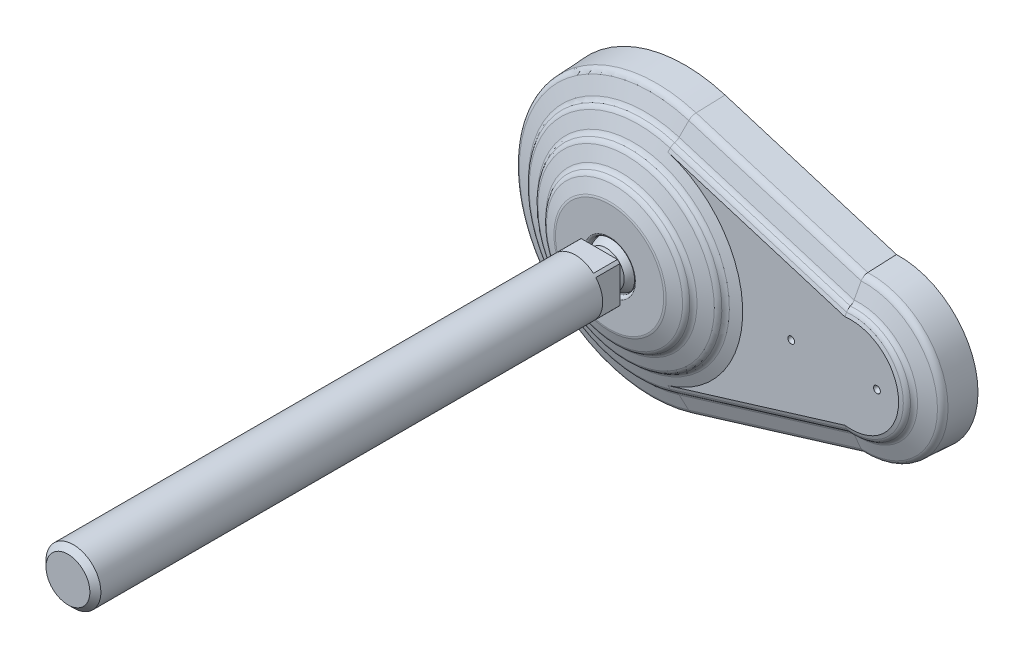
ISO-10303-21;
HEADER;
FILE_DESCRIPTION(('STEP AP214'),'2;1');
FILE_NAME('part.step','',(''),(''),'','','');
FILE_SCHEMA(('AUTOMOTIVE_DESIGN { 1 0 10303 214 1 1 1 1 }'));
ENDSEC;
DATA;
#1=APPLICATION_CONTEXT('core data for automotive mechanical design processes');
#2=APPLICATION_PROTOCOL_DEFINITION('international standard','automotive_design',2000,#1);
#3=PRODUCT_CONTEXT('',#1,'mechanical');
#4=PRODUCT('Part','Part','',(#3));
#5=PRODUCT_RELATED_PRODUCT_CATEGORY('part','',(#4));
#6=PRODUCT_DEFINITION_FORMATION('','',#4);
#7=PRODUCT_DEFINITION_CONTEXT('part definition',#1,'design');
#8=PRODUCT_DEFINITION('design','',#6,#7);
#9=PRODUCT_DEFINITION_SHAPE('','',#8);
#10=(LENGTH_UNIT() NAMED_UNIT(*) SI_UNIT(.MILLI.,.METRE.));
#11=(NAMED_UNIT(*) PLANE_ANGLE_UNIT() SI_UNIT($,.RADIAN.));
#12=(NAMED_UNIT(*) SI_UNIT($,.STERADIAN.) SOLID_ANGLE_UNIT());
#13=UNCERTAINTY_MEASURE_WITH_UNIT(LENGTH_MEASURE(1.E-05),#10,'distance_accuracy_value','');
#14=(GEOMETRIC_REPRESENTATION_CONTEXT(3) GLOBAL_UNCERTAINTY_ASSIGNED_CONTEXT((#13)) GLOBAL_UNIT_ASSIGNED_CONTEXT((#10,
#11,#12)) REPRESENTATION_CONTEXT('',''));
#15=CARTESIAN_POINT('',(0.,0.,0.));
#16=DIRECTION('',(0.,0.,1.));
#17=DIRECTION('',(1.,0.,0.));
#18=AXIS2_PLACEMENT_3D('',#15,#16,#17);
#19=CARTESIAN_POINT('',(0.,0.,32.));
#20=DIRECTION('',(0.,0.,1.));
#21=DIRECTION('',(-1.,0.,0.));
#22=AXIS2_PLACEMENT_3D('',#19,#20,#21);
#23=CYLINDRICAL_SURFACE('',#22,8.);
#24=CARTESIAN_POINT('',(0.,0.,178.4));
#25=DIRECTION('',(0.,0.,1.));
#26=DIRECTION('',(-1.,0.,0.));
#27=AXIS2_PLACEMENT_3D('',#24,#25,#26);
#28=CIRCLE('',#27,8.);
#29=CARTESIAN_POINT('',(-8.,0.,178.4));
#30=VERTEX_POINT('',#29);
#31=EDGE_CURVE('E9',#30,#30,#28,.F.);
#32=ORIENTED_EDGE('',*,*,#31,.T.);
#33=EDGE_LOOP('',(#32));
#34=FACE_BOUND('',#33,.T.);
#35=DIRECTION('',(0.,0.,1.));
#36=VECTOR('',#35,1.);
#37=CARTESIAN_POINT('',(-5.29150262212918,-6.,32.));
#38=LINE('',#37,#36);
#39=CARTESIAN_POINT('',(-5.29150262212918,-6.,32.));
#40=VERTEX_POINT('',#39);
#41=CARTESIAN_POINT('',(-5.29150262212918,-6.,25.));
#42=VERTEX_POINT('',#41);
#43=EDGE_CURVE('E399',#40,#42,#38,.F.);
#44=ORIENTED_EDGE('',*,*,#43,.F.);
#45=CARTESIAN_POINT('',(0.,0.,32.));
#46=DIRECTION('',(0.,0.,1.));
#47=DIRECTION('',(0.,-1.,0.));
#48=AXIS2_PLACEMENT_3D('',#45,#46,#47);
#49=CIRCLE('',#48,8.);
#50=CARTESIAN_POINT('',(5.29150262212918,-6.,32.));
#51=VERTEX_POINT('',#50);
#52=EDGE_CURVE('E486',#40,#51,#49,.T.);
#53=ORIENTED_EDGE('',*,*,#52,.T.);
#54=DIRECTION('',(0.,0.,1.));
#55=VECTOR('',#54,1.);
#56=CARTESIAN_POINT('',(5.29150262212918,-6.,32.));
#57=LINE('',#56,#55);
#58=CARTESIAN_POINT('',(5.29150262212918,-6.,25.));
#59=VERTEX_POINT('',#58);
#60=EDGE_CURVE('E404',#59,#51,#57,.T.);
#61=ORIENTED_EDGE('',*,*,#60,.F.);
#62=CARTESIAN_POINT('',(0.,0.,25.));
#63=DIRECTION('',(0.,0.,1.));
#64=DIRECTION('',(-1.,0.,0.));
#65=AXIS2_PLACEMENT_3D('',#62,#63,#64);
#66=CIRCLE('',#65,8.);
#67=CARTESIAN_POINT('',(6.,-5.29150262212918,25.));
#68=VERTEX_POINT('',#67);
#69=EDGE_CURVE('E522',#59,#68,#66,.T.);
#70=ORIENTED_EDGE('',*,*,#69,.T.);
#71=DIRECTION('',(0.,0.,1.));
#72=VECTOR('',#71,1.);
#73=CARTESIAN_POINT('',(6.,-5.29150262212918,32.));
#74=LINE('',#73,#72);
#75=CARTESIAN_POINT('',(6.,-5.29150262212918,32.));
#76=VERTEX_POINT('',#75);
#77=EDGE_CURVE('E407',#76,#68,#74,.F.);
#78=ORIENTED_EDGE('',*,*,#77,.F.);
#79=CARTESIAN_POINT('',(6.,5.29150262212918,32.));
#80=VERTEX_POINT('',#79);
#81=EDGE_CURVE('E401',#76,#80,#49,.T.);
#82=ORIENTED_EDGE('',*,*,#81,.T.);
#83=DIRECTION('',(0.,0.,1.));
#84=VECTOR('',#83,1.);
#85=CARTESIAN_POINT('',(6.,5.29150262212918,32.));
#86=LINE('',#85,#84);
#87=CARTESIAN_POINT('',(6.,5.29150262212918,25.));
#88=VERTEX_POINT('',#87);
#89=EDGE_CURVE('E417',#88,#80,#86,.T.);
#90=ORIENTED_EDGE('',*,*,#89,.F.);
#91=CARTESIAN_POINT('',(5.29150262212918,6.,25.));
#92=VERTEX_POINT('',#91);
#93=EDGE_CURVE('E520',#88,#92,#66,.T.);
#94=ORIENTED_EDGE('',*,*,#93,.T.);
#95=DIRECTION('',(0.,0.,1.));
#96=VECTOR('',#95,1.);
#97=CARTESIAN_POINT('',(5.29150262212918,6.,32.));
#98=LINE('',#97,#96);
#99=CARTESIAN_POINT('',(5.29150262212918,6.,32.));
#100=VERTEX_POINT('',#99);
#101=EDGE_CURVE('E420',#100,#92,#98,.F.);
#102=ORIENTED_EDGE('',*,*,#101,.F.);
#103=CARTESIAN_POINT('',(-5.29150262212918,6.,32.));
#104=VERTEX_POINT('',#103);
#105=EDGE_CURVE('E485',#100,#104,#49,.T.);
#106=ORIENTED_EDGE('',*,*,#105,.T.);
#107=DIRECTION('',(0.,0.,1.));
#108=VECTOR('',#107,1.);
#109=CARTESIAN_POINT('',(-5.29150262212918,6.,32.));
#110=LINE('',#109,#108);
#111=CARTESIAN_POINT('',(-5.29150262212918,6.,25.));
#112=VERTEX_POINT('',#111);
#113=EDGE_CURVE('E431',#112,#104,#110,.T.);
#114=ORIENTED_EDGE('',*,*,#113,.F.);
#115=CARTESIAN_POINT('',(-6.,5.29150262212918,25.));
#116=VERTEX_POINT('',#115);
#117=EDGE_CURVE('E445',#112,#116,#66,.T.);
#118=ORIENTED_EDGE('',*,*,#117,.T.);
#119=DIRECTION('',(0.,0.,1.));
#120=VECTOR('',#119,1.);
#121=CARTESIAN_POINT('',(-6.,5.29150262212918,32.));
#122=LINE('',#121,#120);
#123=CARTESIAN_POINT('',(-6.,5.29150262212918,32.));
#124=VERTEX_POINT('',#123);
#125=EDGE_CURVE('E434',#124,#116,#122,.F.);
#126=ORIENTED_EDGE('',*,*,#125,.F.);
#127=CARTESIAN_POINT('',(-6.,-5.29150262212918,32.));
#128=VERTEX_POINT('',#127);
#129=EDGE_CURVE('E480',#124,#128,#49,.T.);
#130=ORIENTED_EDGE('',*,*,#129,.T.);
#131=DIRECTION('',(0.,0.,1.));
#132=VECTOR('',#131,1.);
#133=CARTESIAN_POINT('',(-6.,-5.29150262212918,32.));
#134=LINE('',#133,#132);
#135=CARTESIAN_POINT('',(-6.,-5.29150262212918,25.));
#136=VERTEX_POINT('',#135);
#137=EDGE_CURVE('E443',#136,#128,#134,.T.);
#138=ORIENTED_EDGE('',*,*,#137,.F.);
#139=EDGE_CURVE('E388',#136,#42,#66,.T.);
#140=ORIENTED_EDGE('',*,*,#139,.T.);
#141=EDGE_LOOP('',(#44,#53,#61,#70,#78,#82,#90,#94,#102,#106,#114,#118,#126,#130,#138,#140));
#142=FACE_BOUND('',#141,.T.);
#143=ADVANCED_FACE('F14',(#34,#142),#23,.T.);
#144=CARTESIAN_POINT('',(64.1644462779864,-21.755748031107,8.30411735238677));
#145=DIRECTION('',(-0.291971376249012,0.9549953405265,-0.0523126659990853));
#146=DIRECTION('',(-0.956304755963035,-0.292371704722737,0.));
#147=AXIS2_PLACEMENT_3D('',#144,#145,#146);
#148=PLANE('',#147);
#149=CARTESIAN_POINT('',(61.6406997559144,-22.5273238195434,8.30431735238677));
#150=CARTESIAN_POINT('',(61.6501805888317,-22.600242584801,6.92023165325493));
#151=CARTESIAN_POINT('',(61.6596900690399,-22.6731526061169,5.53614569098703));
#152=CARTESIAN_POINT('',(61.6787663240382,-22.8189551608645,2.76797324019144));
#153=CARTESIAN_POINT('',(61.6883330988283,-22.8918476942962,1.38388675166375));
#154=CARTESIAN_POINT('',(61.6979285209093,-22.9647314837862,-0.000200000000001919));
#155=B_SPLINE_CURVE_WITH_KNOTS('',3,(#149,#150,#151,#152,#153,#154),.UNSPECIFIED.,.F.,.F.,(4,2,
4),(0.,4.15811282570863,8.31622565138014),.UNSPECIFIED.);
#156=CARTESIAN_POINT('',(61.6407011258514,-22.5273343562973,8.30411735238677));
#157=VERTEX_POINT('',#156);
#158=CARTESIAN_POINT('',(61.697927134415,-22.9647209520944,0.));
#159=VERTEX_POINT('',#158);
#160=EDGE_CURVE('E645',#157,#159,#155,.T.);
#161=ORIENTED_EDGE('',*,*,#160,.F.);
#162=DIRECTION('',(-0.956304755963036,-0.292371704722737,0.));
#163=VECTOR('',#162,1.);
#164=CARTESIAN_POINT('',(64.1644462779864,-21.755748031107,8.30411735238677));
#165=LINE('',#164,#163);
#166=CARTESIAN_POINT('',(11.5676847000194,-37.8361917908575,8.30411735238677));
#167=VERTEX_POINT('',#166);
#168=EDGE_CURVE('E644',#157,#167,#165,.T.);
#169=ORIENTED_EDGE('',*,*,#168,.T.);
#170=DIRECTION('',(-0.0152947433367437,0.050026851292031,0.998630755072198));
#171=VECTOR('',#170,1.);
#172=CARTESIAN_POINT('',(11.6948681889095,-38.2521902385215,0.));
#173=LINE('',#172,#171);
#174=CARTESIAN_POINT('',(11.6948681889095,-38.2521902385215,0.));
#175=VERTEX_POINT('',#174);
#176=EDGE_CURVE('E585',#175,#167,#173,.T.);
#177=ORIENTED_EDGE('',*,*,#176,.F.);
#178=DIRECTION('',(-0.956304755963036,-0.292371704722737,0.));
#179=VECTOR('',#178,1.);
#180=CARTESIAN_POINT('',(64.2916297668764,-22.1717464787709,0.));
#181=LINE('',#180,#179);
#182=EDGE_CURVE('E31',#159,#175,#181,.T.);
#183=ORIENTED_EDGE('',*,*,#182,.F.);
#184=EDGE_LOOP('',(#161,#169,#177,#183));
#185=FACE_BOUND('',#184,.T.);
#186=ADVANCED_FACE('F338',(#185),#148,.F.);
#187=CARTESIAN_POINT('',(61.6120778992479,-13.407327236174,14.));
#188=DIRECTION('',(-0.102070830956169,0.333858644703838,-0.937080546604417));
#189=DIRECTION('',(0.,0.942000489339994,0.335611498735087));
#190=AXIS2_PLACEMENT_3D('',#187,#188,#189);
#191=PLANE('',#190);
#192=CARTESIAN_POINT('',(60.6773763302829,-13.6925328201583,14.0002));
#193=CARTESIAN_POINT('',(60.6914441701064,-13.863175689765,13.9378718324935));
#194=CARTESIAN_POINT('',(60.7058313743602,-14.0337829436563,13.8755215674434));
#195=CARTESIAN_POINT('',(60.735244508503,-14.3749261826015,13.7507768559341));
#196=CARTESIAN_POINT('',(60.750270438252,-14.5454621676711,13.6883824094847));
#197=CARTESIAN_POINT('',(60.7656157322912,-14.7159625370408,13.6259658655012));
#198=B_SPLINE_CURVE_WITH_KNOTS('',3,(#192,#193,#194,#195,#196,#197),.UNSPECIFIED.,.F.,.F.,(4,2,
4),(0.,0.546637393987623,1.09327466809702),.UNSPECIFIED.);
#199=CARTESIAN_POINT('',(60.677421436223,-13.6930803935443,14.));
#200=VERTEX_POINT('',#199);
#201=CARTESIAN_POINT('',(60.765566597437,-14.7154161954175,13.6261658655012));
#202=VERTEX_POINT('',#201);
#203=EDGE_CURVE('E168',#200,#202,#198,.T.);
#204=ORIENTED_EDGE('',*,*,#203,.F.);
#205=DIRECTION('',(-0.956304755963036,-0.292371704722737,0.));
#206=VECTOR('',#205,1.);
#207=CARTESIAN_POINT('',(61.6120778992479,-13.407327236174,14.));
#208=LINE('',#207,#206);
#209=CARTESIAN_POINT('',(9.01531632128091,-29.4877709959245,14.));
#210=VERTEX_POINT('',#209);
#211=EDGE_CURVE('E172',#200,#210,#208,.T.);
#212=ORIENTED_EDGE('',*,*,#211,.T.);
#213=DIRECTION('',(-0.273975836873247,0.896134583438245,0.349113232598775));
#214=VECTOR('',#213,1.);
#215=CARTESIAN_POINT('',(9.30869253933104,-30.4473613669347,13.6261658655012));
#216=LINE('',#215,#214);
#217=CARTESIAN_POINT('',(9.30869253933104,-30.4473613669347,13.6261658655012));
#218=VERTEX_POINT('',#217);
#219=EDGE_CURVE('E171',#218,#210,#216,.T.);
#220=ORIENTED_EDGE('',*,*,#219,.F.);
#221=DIRECTION('',(-0.956304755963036,-0.292371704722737,0.));
#222=VECTOR('',#221,1.);
#223=CARTESIAN_POINT('',(61.905454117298,-14.3669176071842,13.6261658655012));
#224=LINE('',#223,#222);
#225=EDGE_CURVE('E155',#202,#218,#224,.T.);
#226=ORIENTED_EDGE('',*,*,#225,.F.);
#227=EDGE_LOOP('',(#204,#212,#220,#226));
#228=FACE_BOUND('',#227,.T.);
#229=ADVANCED_FACE('F167',(#228),#191,.F.);
#230=CARTESIAN_POINT('',(62.7507979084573,-17.131912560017,13.5370123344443));
#231=DIRECTION('',(-0.956304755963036,-0.292371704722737,0.));
#232=DIRECTION('',(0.292371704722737,-0.956304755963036,0.));
#233=AXIS2_PLACEMENT_3D('',#230,#231,#232);
#234=CYLINDRICAL_SURFACE('',#233,2.00700000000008);
#235=DIRECTION('',(-0.956304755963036,-0.292371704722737,0.));
#236=VECTOR('',#235,1.);
#237=CARTESIAN_POINT('',(62.545973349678,-16.4619616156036,11.656251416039));
#238=LINE('',#237,#236);
#239=CARTESIAN_POINT('',(60.9818619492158,-16.9401584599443,11.656251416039));
#240=VERTEX_POINT('',#239);
#241=CARTESIAN_POINT('',(9.949211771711,-32.5424053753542,11.656251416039));
#242=VERTEX_POINT('',#241);
#243=EDGE_CURVE('E650',#240,#242,#238,.T.);
#244=ORIENTED_EDGE('',*,*,#243,.F.);
#245=CARTESIAN_POINT('',(60.9819185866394,-16.9407028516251,11.656051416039));
#246=CARTESIAN_POINT('',(60.9763282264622,-16.8869710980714,11.675784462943));
#247=CARTESIAN_POINT('',(60.9708503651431,-16.8340792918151,11.697757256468));
#248=CARTESIAN_POINT('',(60.9601474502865,-16.7302929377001,11.7460604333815));
#249=CARTESIAN_POINT('',(60.9549224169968,-16.6793985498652,11.77239116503));
#250=CARTESIAN_POINT('',(60.9396574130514,-16.5300811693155,11.8578002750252));
#251=CARTESIAN_POINT('',(60.9300410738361,-16.4351542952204,11.9232476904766));
#252=CARTESIAN_POINT('',(60.9121877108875,-16.2575900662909,12.0693279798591));
#253=CARTESIAN_POINT('',(60.9039521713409,-16.1749659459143,12.1499769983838));
#254=CARTESIAN_POINT('',(60.8890756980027,-16.0247595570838,12.3241094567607));
#255=CARTESIAN_POINT('',(60.8824301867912,-15.9571341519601,12.4175548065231));
#256=CARTESIAN_POINT('',(60.8754548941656,-15.8858007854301,12.5364334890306));
#257=CARTESIAN_POINT('',(60.8742920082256,-15.8738939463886,12.5571086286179));
#258=CARTESIAN_POINT('',(60.8720425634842,-15.8508368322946,12.59885583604));
#259=CARTESIAN_POINT('',(60.8709559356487,-15.839685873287,12.6199275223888));
#260=CARTESIAN_POINT('',(60.869906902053,-15.8289098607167,12.6412000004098));
#261=B_SPLINE_CURVE_WITH_KNOTS('',3,(#245,#246,#247,#248,#249,#250,#251,#252,#253,#254,#255,
#256,#257,#258,#259,#260),.UNSPECIFIED.,.F.,.F.,(4,2,2,2,2,2,2,4),(0.,0.172434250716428,
0.34488228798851,0.690191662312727,1.0358698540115,1.38054058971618,1.4521941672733,
1.52378201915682),.UNSPECIFIED.);
#262=CARTESIAN_POINT('',(60.8699167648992,-15.8290111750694,12.6410000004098));
#263=VERTEX_POINT('',#262);
#264=EDGE_CURVE('E266',#240,#263,#261,.T.);
#265=ORIENTED_EDGE('',*,*,#264,.T.);
#266=DIRECTION('',(-0.956304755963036,-0.292371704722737,0.));
#267=VECTOR('',#266,1.);
#268=CARTESIAN_POINT('',(62.2257313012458,-15.4144970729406,12.6410000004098));
#269=LINE('',#268,#267);
#270=CARTESIAN_POINT('',(9.62896972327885,-31.4949408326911,12.6410000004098));
#271=VERTEX_POINT('',#270);
#272=EDGE_CURVE('E157',#263,#271,#269,.T.);
#273=ORIENTED_EDGE('',*,*,#272,.T.);
#274=CARTESIAN_POINT('',(10.1540363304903,-33.2123563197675,13.5370123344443));
#275=DIRECTION('',(0.956304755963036,0.292371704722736,0.));
#276=DIRECTION('',(-0.292371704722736,0.956304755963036,0.));
#277=AXIS2_PLACEMENT_3D('',#274,#275,#276);
#278=CIRCLE('',#277,2.00700000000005);
#279=EDGE_CURVE('E597',#242,#271,#278,.T.);
#280=ORIENTED_EDGE('',*,*,#279,.F.);
#281=EDGE_LOOP('',(#244,#265,#273,#280));
#282=FACE_BOUND('',#281,.T.);
#283=ADVANCED_FACE('F317',(#282),#234,.F.);
#284=CARTESIAN_POINT('',(62.545973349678,-16.4619616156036,11.656251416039));
#285=DIRECTION('',(-0.102055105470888,0.333807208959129,-0.937100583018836));
#286=DIRECTION('',(0.,0.942019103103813,0.335559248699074));
#287=AXIS2_PLACEMENT_3D('',#284,#285,#286);
#288=PLANE('',#287);
#289=CARTESIAN_POINT('',(60.9818053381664,-16.9396143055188,11.656451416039));
#290=CARTESIAN_POINT('',(61.0189355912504,-17.2964789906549,11.5252879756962));
#291=CARTESIAN_POINT('',(61.0571375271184,-17.653206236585,11.3940567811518));
#292=CARTESIAN_POINT('',(61.1355151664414,-18.3663907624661,11.1314756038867));
#293=CARTESIAN_POINT('',(61.1756908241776,-18.7228480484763,11.0001256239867));
#294=CARTESIAN_POINT('',(61.2578477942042,-19.435511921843,10.7373183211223));
#295=CARTESIAN_POINT('',(61.2998290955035,-19.7917185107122,10.6058609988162));
#296=CARTESIAN_POINT('',(61.3854616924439,-20.5039033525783,10.3428458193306));
#297=CARTESIAN_POINT('',(61.4291130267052,-20.8598816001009,10.2112879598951));
#298=CARTESIAN_POINT('',(61.4735304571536,-21.2157475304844,10.0796866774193));
#299=B_SPLINE_CURVE_WITH_KNOTS('',3,(#289,#290,#291,#292,#293,#294,#295,#296,#297,#298),
.UNSPECIFIED.,.F.,.F.,(4,2,2,2,4),(0.,1.14603990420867,2.29205327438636,3.43805966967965,
4.58409258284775),.UNSPECIFIED.);
#300=CARTESIAN_POINT('',(61.4734629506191,-21.2152067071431,10.0798866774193));
#301=VERTEX_POINT('',#300);
#302=EDGE_CURVE('E298',#240,#301,#299,.T.);
#303=ORIENTED_EDGE('',*,*,#302,.F.);
#304=ORIENTED_EDGE('',*,*,#243,.T.);
#305=DIRECTION('',(-0.273981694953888,0.896153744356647,0.349059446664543));
#306=VECTOR('',#305,1.);
#307=CARTESIAN_POINT('',(11.1865227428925,-36.5894672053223,10.0798866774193));
#308=LINE('',#307,#306);
#309=CARTESIAN_POINT('',(11.1865227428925,-36.5894672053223,10.0798866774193));
#310=VERTEX_POINT('',#309);
#311=EDGE_CURVE('E594',#310,#242,#308,.T.);
#312=ORIENTED_EDGE('',*,*,#311,.F.);
#313=DIRECTION('',(-0.956304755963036,-0.292371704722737,0.));
#314=VECTOR('',#313,1.);
#315=CARTESIAN_POINT('',(63.7832843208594,-20.5090234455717,10.0798866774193));
#316=LINE('',#315,#314);
#317=EDGE_CURVE('E647',#301,#310,#316,.T.);
#318=ORIENTED_EDGE('',*,*,#317,.F.);
#319=EDGE_LOOP('',(#303,#304,#312,#318));
#320=FACE_BOUND('',#319,.T.);
#321=ADVANCED_FACE('F312',(#320),#288,.F.);
#322=CARTESIAN_POINT('',(64.2916297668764,22.1717464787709,0.));
#323=DIRECTION('',(-0.291971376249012,-0.9549953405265,-0.0523126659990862));
#324=DIRECTION('',(0.956304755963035,-0.292371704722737,0.));
#325=AXIS2_PLACEMENT_3D('',#322,#323,#324);
#326=PLANE('',#325);
#327=CARTESIAN_POINT('',(61.6979285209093,22.9647314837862,-0.000199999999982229));
#328=CARTESIAN_POINT('',(61.6883330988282,22.8918476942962,1.38388675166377));
#329=CARTESIAN_POINT('',(61.6787663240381,22.8189551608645,2.76797324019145));
#330=CARTESIAN_POINT('',(61.6596900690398,22.6731526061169,5.53614569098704));
#331=CARTESIAN_POINT('',(61.6501805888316,22.600242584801,6.92023165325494));
#332=CARTESIAN_POINT('',(61.6406997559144,22.5273238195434,8.30431735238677));
#333=B_SPLINE_CURVE_WITH_KNOTS('',3,(#327,#328,#329,#330,#331,#332),.UNSPECIFIED.,.F.,.F.,(4,2,
4),(0.,4.1581128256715,8.31622565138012),.UNSPECIFIED.);
#334=CARTESIAN_POINT('',(61.6979271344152,22.9647209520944,0.));
#335=VERTEX_POINT('',#334);
#336=CARTESIAN_POINT('',(61.6407011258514,22.5273343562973,8.30411735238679));
#337=VERTEX_POINT('',#336);
#338=EDGE_CURVE('E694',#335,#337,#333,.T.);
#339=ORIENTED_EDGE('',*,*,#338,.F.);
#340=DIRECTION('',(-0.956304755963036,0.292371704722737,0.));
#341=VECTOR('',#340,1.);
#342=CARTESIAN_POINT('',(64.2916297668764,22.1717464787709,0.));
#343=LINE('',#342,#341);
#344=CARTESIAN_POINT('',(11.6948681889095,38.2521902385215,0.));
#345=VERTEX_POINT('',#344);
#346=EDGE_CURVE('E648',#335,#345,#343,.T.);
#347=ORIENTED_EDGE('',*,*,#346,.T.);
#348=DIRECTION('',(-0.0152947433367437,-0.050026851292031,0.998630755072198));
#349=VECTOR('',#348,1.);
#350=CARTESIAN_POINT('',(11.6948681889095,38.2521902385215,0.));
#351=LINE('',#350,#349);
#352=CARTESIAN_POINT('',(11.5676847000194,37.8361917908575,8.30411735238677));
#353=VERTEX_POINT('',#352);
#354=EDGE_CURVE('E603',#345,#353,#351,.T.);
#355=ORIENTED_EDGE('',*,*,#354,.T.);
#356=DIRECTION('',(-0.956304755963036,0.292371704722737,0.));
#357=VECTOR('',#356,1.);
#358=CARTESIAN_POINT('',(64.1644462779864,21.755748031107,8.30411735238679));
#359=LINE('',#358,#357);
#360=EDGE_CURVE('E652',#337,#353,#359,.T.);
#361=ORIENTED_EDGE('',*,*,#360,.F.);
#362=EDGE_LOOP('',(#339,#347,#355,#361));
#363=FACE_BOUND('',#362,.T.);
#364=ADVANCED_FACE('F316',(#363),#326,.F.);
#365=CARTESIAN_POINT('',(63.7832843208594,20.5090234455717,10.0798866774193));
#366=DIRECTION('',(-0.102055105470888,-0.333807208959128,-0.937100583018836));
#367=DIRECTION('',(0.,0.942019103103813,-0.335559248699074));
#368=AXIS2_PLACEMENT_3D('',#365,#366,#367);
#369=PLANE('',#368);
#370=CARTESIAN_POINT('',(61.4735304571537,21.2157475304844,10.0796866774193));
#371=CARTESIAN_POINT('',(61.4291130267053,20.8598816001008,10.2112879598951));
#372=CARTESIAN_POINT('',(61.3854616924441,20.5039033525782,10.3428458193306));
#373=CARTESIAN_POINT('',(61.2998290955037,19.7917185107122,10.6058609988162));
#374=CARTESIAN_POINT('',(61.2578477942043,19.435511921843,10.7373183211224));
#375=CARTESIAN_POINT('',(61.1756908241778,18.7228480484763,11.0001256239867));
#376=CARTESIAN_POINT('',(61.1355151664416,18.3663907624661,11.1314756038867));
#377=CARTESIAN_POINT('',(61.0571375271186,17.653206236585,11.3940567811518));
#378=CARTESIAN_POINT('',(61.0189355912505,17.2964789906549,11.5252879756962));
#379=CARTESIAN_POINT('',(60.9818053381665,16.9396143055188,11.656451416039));
#380=B_SPLINE_CURVE_WITH_KNOTS('',3,(#370,#371,#372,#373,#374,#375,#376,#377,#378,#379),
.UNSPECIFIED.,.F.,.F.,(4,2,2,2,4),(0.,1.1460329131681,2.29203930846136,3.43805267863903,
4.58409258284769),.UNSPECIFIED.);
#381=CARTESIAN_POINT('',(61.4734629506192,21.2152067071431,10.0798866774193));
#382=VERTEX_POINT('',#381);
#383=CARTESIAN_POINT('',(60.9818619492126,16.9401584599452,11.656251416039));
#384=VERTEX_POINT('',#383);
#385=EDGE_CURVE('E292',#382,#384,#380,.T.);
#386=ORIENTED_EDGE('',*,*,#385,.F.);
#387=DIRECTION('',(-0.956304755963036,0.292371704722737,0.));
#388=VECTOR('',#387,1.);
#389=CARTESIAN_POINT('',(63.7832843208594,20.5090234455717,10.0798866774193));
#390=LINE('',#389,#388);
#391=CARTESIAN_POINT('',(11.1865227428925,36.5894672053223,10.0798866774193));
#392=VERTEX_POINT('',#391);
#393=EDGE_CURVE('E683',#382,#392,#390,.T.);
#394=ORIENTED_EDGE('',*,*,#393,.T.);
#395=DIRECTION('',(-0.273981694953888,-0.896153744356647,0.349059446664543));
#396=VECTOR('',#395,1.);
#397=CARTESIAN_POINT('',(11.1865227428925,36.5894672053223,10.0798866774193));
#398=LINE('',#397,#396);
#399=CARTESIAN_POINT('',(9.949211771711,32.5424053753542,11.656251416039));
#400=VERTEX_POINT('',#399);
#401=EDGE_CURVE('E609',#392,#400,#398,.T.);
#402=ORIENTED_EDGE('',*,*,#401,.T.);
#403=DIRECTION('',(-0.956304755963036,0.292371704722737,0.));
#404=VECTOR('',#403,1.);
#405=CARTESIAN_POINT('',(62.545973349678,16.4619616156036,11.656251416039));
#406=LINE('',#405,#404);
#407=EDGE_CURVE('E684',#384,#400,#406,.T.);
#408=ORIENTED_EDGE('',*,*,#407,.F.);
#409=EDGE_LOOP('',(#386,#394,#402,#408));
#410=FACE_BOUND('',#409,.T.);
#411=ADVANCED_FACE('F255',(#410),#369,.F.);
#412=CARTESIAN_POINT('',(62.7507979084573,17.1319125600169,13.5370123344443));
#413=DIRECTION('',(-0.956304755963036,0.292371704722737,0.));
#414=DIRECTION('',(-0.292371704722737,-0.956304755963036,0.));
#415=AXIS2_PLACEMENT_3D('',#412,#413,#414);
#416=CYLINDRICAL_SURFACE('',#415,2.007);
#417=DIRECTION('',(-0.956304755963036,0.292371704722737,0.));
#418=VECTOR('',#417,1.);
#419=CARTESIAN_POINT('',(62.2257313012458,15.4144970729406,12.6410000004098));
#420=LINE('',#419,#418);
#421=CARTESIAN_POINT('',(60.8699167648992,15.8290111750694,12.6410000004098));
#422=VERTEX_POINT('',#421);
#423=CARTESIAN_POINT('',(9.62896972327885,31.4949408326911,12.6410000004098));
#424=VERTEX_POINT('',#423);
#425=EDGE_CURVE('E773',#422,#424,#420,.T.);
#426=ORIENTED_EDGE('',*,*,#425,.F.);
#427=CARTESIAN_POINT('',(60.869906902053,15.8289098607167,12.6412000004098));
#428=CARTESIAN_POINT('',(60.8724049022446,15.8545692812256,12.5905409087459));
#429=CARTESIAN_POINT('',(60.8751177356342,15.882373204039,12.5410120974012));
#430=CARTESIAN_POINT('',(60.8809599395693,15.9420653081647,12.4445128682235));
#431=CARTESIAN_POINT('',(60.8840892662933,15.9739530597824,12.3975421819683));
#432=CARTESIAN_POINT('',(60.8940798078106,16.0754098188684,12.2609440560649));
#433=CARTESIAN_POINT('',(60.9015461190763,16.1507985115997,12.1755790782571));
#434=CARTESIAN_POINT('',(60.9179069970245,16.3146445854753,12.0187596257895));
#435=CARTESIAN_POINT('',(60.9268017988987,16.4031041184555,11.9473074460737));
#436=CARTESIAN_POINT('',(60.9458071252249,16.5904449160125,11.8202080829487));
#437=CARTESIAN_POINT('',(60.9559150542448,16.6893038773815,11.7645279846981));
#438=CARTESIAN_POINT('',(60.9690169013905,16.8162843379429,11.7062217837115));
#439=CARTESIAN_POINT('',(60.9715630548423,16.8409104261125,11.6954970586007));
#440=CARTESIAN_POINT('',(60.9767040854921,16.8905299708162,11.6750365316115));
#441=CARTESIAN_POINT('',(60.9792989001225,16.9155229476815,11.6652995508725));
#442=CARTESIAN_POINT('',(60.9819185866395,16.940702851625,11.656051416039));
#443=B_SPLINE_CURVE_WITH_KNOTS('',3,(#427,#428,#429,#430,#431,#432,#433,#434,#435,#436,#437,
#438,#439,#440,#441,#442),.UNSPECIFIED.,.F.,.F.,(4,2,2,2,2,2,2,4),(0.,0.170415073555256,
0.340812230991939,0.681435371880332,1.0221146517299,1.36207763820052,1.44300799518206,
1.52384059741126),.UNSPECIFIED.);
#444=EDGE_CURVE('E161',#422,#384,#443,.T.);
#445=ORIENTED_EDGE('',*,*,#444,.T.);
#446=ORIENTED_EDGE('',*,*,#407,.T.);
#447=CARTESIAN_POINT('',(10.1540363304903,33.2123563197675,13.5370123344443));
#448=DIRECTION('',(-0.956304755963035,0.292371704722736,0.));
#449=DIRECTION('',(-0.292371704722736,-0.956304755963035,0.));
#450=AXIS2_PLACEMENT_3D('',#447,#448,#449);
#451=CIRCLE('',#450,2.00700000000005);
#452=EDGE_CURVE('E612',#400,#424,#451,.T.);
#453=ORIENTED_EDGE('',*,*,#452,.T.);
#454=EDGE_LOOP('',(#426,#445,#446,#453));
#455=FACE_BOUND('',#454,.T.);
#456=ADVANCED_FACE('F242',(#455),#416,.F.);
#457=CARTESIAN_POINT('',(61.905454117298,14.3669176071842,13.6261658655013));
#458=DIRECTION('',(-0.102070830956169,-0.333858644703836,-0.937080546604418));
#459=DIRECTION('',(0.,0.942000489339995,-0.335611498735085));
#460=AXIS2_PLACEMENT_3D('',#457,#458,#459);
#461=PLANE('',#460);
#462=CARTESIAN_POINT('',(60.7656157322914,14.7159625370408,13.6259658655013));
#463=CARTESIAN_POINT('',(60.7502704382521,14.5454621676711,13.6883824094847));
#464=CARTESIAN_POINT('',(60.735244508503,14.3749261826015,13.7507768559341));
#465=CARTESIAN_POINT('',(60.7058313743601,14.0337829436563,13.8755215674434));
#466=CARTESIAN_POINT('',(60.6914441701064,13.863175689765,13.9378718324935));
#467=CARTESIAN_POINT('',(60.6773763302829,13.6925328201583,14.0002));
#468=B_SPLINE_CURVE_WITH_KNOTS('',3,(#462,#463,#464,#465,#466,#467),.UNSPECIFIED.,.F.,.F.,(4,2,
4),(0.,0.546637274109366,1.09327466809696),.UNSPECIFIED.);
#469=CARTESIAN_POINT('',(60.7655665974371,14.7154161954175,13.6261658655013));
#470=VERTEX_POINT('',#469);
#471=CARTESIAN_POINT('',(60.6774214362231,13.6930803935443,14.));
#472=VERTEX_POINT('',#471);
#473=EDGE_CURVE('E225',#470,#472,#468,.T.);
#474=ORIENTED_EDGE('',*,*,#473,.F.);
#475=DIRECTION('',(-0.956304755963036,0.292371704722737,0.));
#476=VECTOR('',#475,1.);
#477=CARTESIAN_POINT('',(61.905454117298,14.3669176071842,13.6261658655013));
#478=LINE('',#477,#476);
#479=CARTESIAN_POINT('',(9.30869253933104,30.4473613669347,13.6261658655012));
#480=VERTEX_POINT('',#479);
#481=EDGE_CURVE('E771',#470,#480,#478,.T.);
#482=ORIENTED_EDGE('',*,*,#481,.T.);
#483=DIRECTION('',(-0.273975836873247,-0.896134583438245,0.349113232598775));
#484=VECTOR('',#483,1.);
#485=CARTESIAN_POINT('',(9.30869253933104,30.4473613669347,13.6261658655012));
#486=LINE('',#485,#484);
#487=CARTESIAN_POINT('',(9.01531632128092,29.4877709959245,14.));
#488=VERTEX_POINT('',#487);
#489=EDGE_CURVE('E618',#480,#488,#486,.T.);
#490=ORIENTED_EDGE('',*,*,#489,.T.);
#491=DIRECTION('',(-0.956304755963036,0.292371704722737,0.));
#492=VECTOR('',#491,1.);
#493=CARTESIAN_POINT('',(61.6120778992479,13.4073272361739,14.));
#494=LINE('',#493,#492);
#495=EDGE_CURVE('E75',#472,#488,#494,.T.);
#496=ORIENTED_EDGE('',*,*,#495,.F.);
#497=EDGE_LOOP('',(#474,#482,#490,#496));
#498=FACE_BOUND('',#497,.T.);
#499=ADVANCED_FACE('F237',(#498),#461,.F.);
#500=CARTESIAN_POINT('',(0.,0.,0.));
#501=DIRECTION('',(0.,0.,1.));
#502=DIRECTION('',(-1.,0.,0.));
#503=AXIS2_PLACEMENT_3D('',#500,#501,#502);
#504=PLANE('',#503);
#505=ORIENTED_EDGE('',*,*,#346,.F.);
#506=CARTESIAN_POINT('',(62.5,0.,0.));
#507=DIRECTION('',(0.,0.,1.));
#508=DIRECTION('',(0.,-1.,0.));
#509=AXIS2_PLACEMENT_3D('',#506,#507,#508);
#510=CIRCLE('',#509,22.9787234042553);
#511=EDGE_CURVE('E181',#159,#335,#510,.T.);
#512=ORIENTED_EDGE('',*,*,#511,.F.);
#513=ORIENTED_EDGE('',*,*,#182,.T.);
#514=CARTESIAN_POINT('',(0.,0.,0.));
#515=DIRECTION('',(0.,0.,1.));
#516=DIRECTION('',(-1.,0.,0.));
#517=AXIS2_PLACEMENT_3D('',#514,#515,#516);
#518=CIRCLE('',#517,40.);
#519=EDGE_CURVE('E233',#345,#175,#518,.T.);
#520=ORIENTED_EDGE('',*,*,#519,.F.);
#521=EDGE_LOOP('',(#505,#512,#513,#520));
#522=FACE_BOUND('',#521,.T.);
#523=CARTESIAN_POINT('',(70.,0.,0.));
#524=DIRECTION('',(0.,0.,-1.));
#525=DIRECTION('',(0.,1.,0.));
#526=AXIS2_PLACEMENT_3D('',#523,#524,#525);
#527=CIRCLE('',#526,5.25);
#528=CARTESIAN_POINT('',(70.,5.25,0.));
#529=VERTEX_POINT('',#528);
#530=EDGE_CURVE('E491',#529,#529,#527,.T.);
#531=ORIENTED_EDGE('',*,*,#530,.F.);
#532=EDGE_LOOP('',(#531));
#533=FACE_BOUND('',#532,.T.);
#534=CARTESIAN_POINT('',(45.,0.,0.));
#535=DIRECTION('',(0.,0.,-1.));
#536=DIRECTION('',(0.,1.,0.));
#537=AXIS2_PLACEMENT_3D('',#534,#535,#536);
#538=CIRCLE('',#537,5.25);
#539=CARTESIAN_POINT('',(45.,5.25,0.));
#540=VERTEX_POINT('',#539);
#541=EDGE_CURVE('E1165',#540,#540,#538,.T.);
#542=ORIENTED_EDGE('',*,*,#541,.F.);
#543=EDGE_LOOP('',(#542));
#544=FACE_BOUND('',#543,.T.);
#545=ADVANCED_FACE('F241',(#522,#533,#544),#504,.F.);
#546=CARTESIAN_POINT('',(0.,0.,0.));
#547=DIRECTION('',(0.,0.,-1.));
#548=DIRECTION('',(1.,0.,0.));
#549=AXIS2_PLACEMENT_3D('',#546,#547,#548);
#550=CONICAL_SURFACE('',#549,40.,0.0523365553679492);
#551=CARTESIAN_POINT('',(0.,0.,8.30411735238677));
#552=DIRECTION('',(0.,0.,1.));
#553=DIRECTION('',(-1.,0.,0.));
#554=AXIS2_PLACEMENT_3D('',#551,#552,#553);
#555=CIRCLE('',#554,39.5649938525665);
#556=EDGE_CURVE('E631',#353,#167,#555,.T.);
#557=ORIENTED_EDGE('',*,*,#556,.F.);
#558=ORIENTED_EDGE('',*,*,#354,.F.);
#559=ORIENTED_EDGE('',*,*,#519,.T.);
#560=ORIENTED_EDGE('',*,*,#176,.T.);
#561=EDGE_LOOP('',(#557,#558,#559,#560));
#562=FACE_BOUND('',#561,.T.);
#563=ADVANCED_FACE('F640',(#562),#550,.T.);
#564=CARTESIAN_POINT('',(0.,0.,8.19912580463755));
#565=DIRECTION('',(0.,0.,1.));
#566=DIRECTION('',(-1.,0.,0.));
#567=AXIS2_PLACEMENT_3D('',#564,#565,#566);
#568=TOROIDAL_SURFACE('',#567,37.5607419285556,2.007);
#569=CARTESIAN_POINT('',(0.,0.,10.0798866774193));
#570=DIRECTION('',(0.,0.,1.));
#571=DIRECTION('',(-1.,0.,0.));
#572=AXIS2_PLACEMENT_3D('',#569,#570,#571);
#573=CIRCLE('',#572,38.2613042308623);
#574=EDGE_CURVE('E629',#392,#310,#573,.T.);
#575=ORIENTED_EDGE('',*,*,#574,.F.);
#576=CARTESIAN_POINT('',(10.9816981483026,35.9195161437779,8.19912580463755));
#577=DIRECTION('',(-0.956304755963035,0.292371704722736,0.));
#578=DIRECTION('',(-0.292371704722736,-0.956304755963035,0.));
#579=AXIS2_PLACEMENT_3D('',#576,#577,#578);
#580=CIRCLE('',#579,2.007);
#581=EDGE_CURVE('E606',#392,#353,#580,.T.);
#582=ORIENTED_EDGE('',*,*,#581,.T.);
#583=ORIENTED_EDGE('',*,*,#556,.T.);
#584=CARTESIAN_POINT('',(10.9816981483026,-35.9195161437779,8.19912580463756));
#585=DIRECTION('',(0.956304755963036,0.292371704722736,0.));
#586=DIRECTION('',(-0.292371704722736,0.956304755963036,0.));
#587=AXIS2_PLACEMENT_3D('',#584,#585,#586);
#588=CIRCLE('',#587,2.007);
#589=EDGE_CURVE('E591',#310,#167,#588,.T.);
#590=ORIENTED_EDGE('',*,*,#589,.F.);
#591=EDGE_LOOP('',(#575,#582,#583,#590));
#592=FACE_BOUND('',#591,.T.);
#593=ADVANCED_FACE('F777',(#592),#568,.T.);
#594=CARTESIAN_POINT('',(0.,0.,10.0798866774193));
#595=DIRECTION('',(0.,0.,-1.));
#596=DIRECTION('',(1.,0.,0.));
#597=AXIS2_PLACEMENT_3D('',#594,#595,#596);
#598=CONICAL_SURFACE('',#597,38.2613042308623,1.21422909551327);
#599=CARTESIAN_POINT('',(0.,0.,11.656251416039));
#600=DIRECTION('',(0.,0.,1.));
#601=DIRECTION('',(-1.,0.,0.));
#602=AXIS2_PLACEMENT_3D('',#599,#600,#601);
#603=CIRCLE('',#602,34.0293250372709);
#604=EDGE_CURVE('E626',#400,#242,#603,.T.);
#605=ORIENTED_EDGE('',*,*,#604,.F.);
#606=ORIENTED_EDGE('',*,*,#401,.F.);
#607=ORIENTED_EDGE('',*,*,#574,.T.);
#608=ORIENTED_EDGE('',*,*,#311,.T.);
#609=EDGE_LOOP('',(#605,#606,#607,#608));
#610=FACE_BOUND('',#609,.T.);
#611=ADVANCED_FACE('F672',(#610),#598,.T.);
#612=CARTESIAN_POINT('',(0.,0.,13.5370123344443));
#613=DIRECTION('',(0.,0.,1.));
#614=DIRECTION('',(-1.,0.,0.));
#615=AXIS2_PLACEMENT_3D('',#612,#613,#614);
#616=TOROIDAL_SURFACE('',#615,34.7298872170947,2.00700000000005);
#617=CARTESIAN_POINT('',(0.,0.,12.6410000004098));
#618=DIRECTION('',(0.,0.,1.));
#619=DIRECTION('',(-1.,0.,0.));
#620=AXIS2_PLACEMENT_3D('',#617,#618,#619);
#621=CIRCLE('',#620,32.9339999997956);
#622=EDGE_CURVE('E623',#424,#271,#621,.T.);
#623=ORIENTED_EDGE('',*,*,#622,.F.);
#624=ORIENTED_EDGE('',*,*,#452,.F.);
#625=ORIENTED_EDGE('',*,*,#604,.T.);
#626=ORIENTED_EDGE('',*,*,#279,.T.);
#627=EDGE_LOOP('',(#623,#624,#625,#626));
#628=FACE_BOUND('',#627,.T.);
#629=ADVANCED_FACE('F667',(#628),#616,.F.);
#630=CARTESIAN_POINT('',(0.,0.,11.7454451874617));
#631=DIRECTION('',(0.,0.,1.));
#632=DIRECTION('',(-1.,0.,0.));
#633=AXIS2_PLACEMENT_3D('',#630,#631,#632);
#634=TOROIDAL_SURFACE('',#633,31.1378845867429,2.007);
#635=CARTESIAN_POINT('',(0.,0.,13.6261658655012));
#636=DIRECTION('',(0.,0.,1.));
#637=DIRECTION('',(-1.,0.,0.));
#638=AXIS2_PLACEMENT_3D('',#635,#636,#637);
#639=CIRCLE('',#638,31.8385547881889);
#640=EDGE_CURVE('E621',#480,#218,#639,.T.);
#641=ORIENTED_EDGE('',*,*,#640,.F.);
#642=CARTESIAN_POINT('',(9.10383639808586,29.7773071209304,11.7454451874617));
#643=DIRECTION('',(-0.956304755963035,0.292371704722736,0.));
#644=DIRECTION('',(-0.292371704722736,-0.956304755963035,0.));
#645=AXIS2_PLACEMENT_3D('',#642,#643,#644);
#646=CIRCLE('',#645,2.007);
#647=EDGE_CURVE('E615',#480,#424,#646,.T.);
#648=ORIENTED_EDGE('',*,*,#647,.T.);
#649=ORIENTED_EDGE('',*,*,#622,.T.);
#650=CARTESIAN_POINT('',(9.10383639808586,-29.7773071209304,11.7454451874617));
#651=DIRECTION('',(0.956304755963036,0.292371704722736,0.));
#652=DIRECTION('',(-0.292371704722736,0.956304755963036,0.));
#653=AXIS2_PLACEMENT_3D('',#650,#651,#652);
#654=CIRCLE('',#653,2.007);
#655=EDGE_CURVE('E600',#218,#271,#654,.T.);
#656=ORIENTED_EDGE('',*,*,#655,.F.);
#657=EDGE_LOOP('',(#641,#648,#649,#656));
#658=FACE_BOUND('',#657,.T.);
#659=ADVANCED_FACE('F663',(#658),#634,.T.);
#660=CARTESIAN_POINT('',(0.,0.,13.6261658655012));
#661=DIRECTION('',(0.,0.,-1.));
#662=DIRECTION('',(1.,0.,0.));
#663=AXIS2_PLACEMENT_3D('',#660,#661,#662);
#664=CONICAL_SURFACE('',#663,31.8385547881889,1.21417169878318);
#665=CARTESIAN_POINT('',(0.,0.,15.054));
#666=DIRECTION('',(0.,0.,1.));
#667=DIRECTION('',(0.,-1.,0.));
#668=AXIS2_PLACEMENT_3D('',#665,#666,#667);
#669=CIRCLE('',#668,28.006);
#670=CARTESIAN_POINT('',(0.,-28.006,15.054));
#671=VERTEX_POINT('',#670);
#672=EDGE_CURVE('E780',#671,#671,#669,.T.);
#673=ORIENTED_EDGE('',*,*,#672,.F.);
#674=EDGE_LOOP('',(#673));
#675=FACE_BOUND('',#674,.T.);
#676=CARTESIAN_POINT('',(0.,0.,14.));
#677=DIRECTION('',(0.,0.,1.));
#678=DIRECTION('',(0.,-1.,0.));
#679=AXIS2_PLACEMENT_3D('',#676,#677,#678);
#680=CIRCLE('',#679,30.8351190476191);
#681=EDGE_CURVE('E583',#210,#488,#680,.T.);
#682=ORIENTED_EDGE('',*,*,#681,.T.);
#683=ORIENTED_EDGE('',*,*,#489,.F.);
#684=ORIENTED_EDGE('',*,*,#640,.T.);
#685=ORIENTED_EDGE('',*,*,#219,.T.);
#686=EDGE_LOOP('',(#682,#683,#684,#685));
#687=FACE_BOUND('',#686,.T.);
#688=ADVANCED_FACE('F334',(#675,#687),#664,.T.);
#689=CARTESIAN_POINT('',(9.01531632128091,29.4877709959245,14.));
#690=DIRECTION('',(0.,0.,-1.));
#691=DIRECTION('',(1.,0.,0.));
#692=AXIS2_PLACEMENT_3D('',#689,#690,#691);
#693=PLANE('',#692);
#694=CARTESIAN_POINT('',(45.,0.,14.));
#695=DIRECTION('',(0.,0.,-1.));
#696=DIRECTION('',(0.,1.,0.));
#697=AXIS2_PLACEMENT_3D('',#694,#695,#696);
#698=CIRCLE('',#697,1.);
#699=CARTESIAN_POINT('',(45.,1.,14.));
#700=VERTEX_POINT('',#699);
#701=EDGE_CURVE('E439',#700,#700,#698,.T.);
#702=ORIENTED_EDGE('',*,*,#701,.T.);
#703=EDGE_LOOP('',(#702));
#704=FACE_BOUND('',#703,.T.);
#705=CARTESIAN_POINT('',(70.,0.,14.));
#706=DIRECTION('',(0.,0.,-1.));
#707=DIRECTION('',(0.,1.,0.));
#708=AXIS2_PLACEMENT_3D('',#705,#706,#707);
#709=CIRCLE('',#708,1.);
#710=CARTESIAN_POINT('',(70.,1.,14.));
#711=VERTEX_POINT('',#710);
#712=EDGE_CURVE('E576',#711,#711,#709,.T.);
#713=ORIENTED_EDGE('',*,*,#712,.T.);
#714=EDGE_LOOP('',(#713));
#715=FACE_BOUND('',#714,.T.);
#716=ORIENTED_EDGE('',*,*,#211,.F.);
#717=CARTESIAN_POINT('',(62.5,0.,14.));
#718=DIRECTION('',(0.,0.,1.));
#719=DIRECTION('',(0.,-1.,0.));
#720=AXIS2_PLACEMENT_3D('',#717,#718,#719);
#721=CIRCLE('',#720,13.8138424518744);
#722=EDGE_CURVE('E180',#200,#472,#721,.T.);
#723=ORIENTED_EDGE('',*,*,#722,.T.);
#724=ORIENTED_EDGE('',*,*,#495,.T.);
#725=ORIENTED_EDGE('',*,*,#681,.F.);
#726=EDGE_LOOP('',(#716,#723,#724,#725));
#727=FACE_BOUND('',#726,.T.);
#728=ADVANCED_FACE('F327',(#704,#715,#727),#693,.F.);
#729=CARTESIAN_POINT('',(61.7005979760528,-13.6968633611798,11.7454451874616));
#730=DIRECTION('',(-0.956304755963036,-0.292371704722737,0.));
#731=DIRECTION('',(0.292371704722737,-0.956304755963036,0.));
#732=AXIS2_PLACEMENT_3D('',#729,#730,#731);
#733=CYLINDRICAL_SURFACE('',#732,2.007);
#734=ORIENTED_EDGE('',*,*,#272,.F.);
#735=CARTESIAN_POINT('',(60.8699266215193,-15.8291124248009,12.6408000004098));
#736=CARTESIAN_POINT('',(60.8674327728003,-15.8034938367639,12.6914108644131));
#737=CARTESIAN_POINT('',(60.8647362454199,-15.7757317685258,12.74089344));
#738=CARTESIAN_POINT('',(60.858964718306,-15.7161228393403,12.8373036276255));
#739=CARTESIAN_POINT('',(60.8558897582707,-15.6842764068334,12.8842315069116));
#740=CARTESIAN_POINT('',(60.8461407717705,-15.5829473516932,13.0206941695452));
#741=CARTESIAN_POINT('',(60.8389394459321,-15.5076423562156,13.1059721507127));
#742=CARTESIAN_POINT('',(60.8234284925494,-15.3439431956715,13.2626343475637));
#743=CARTESIAN_POINT('',(60.8151186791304,-15.2555468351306,13.3340162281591));
#744=CARTESIAN_POINT('',(60.7977056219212,-15.0683060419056,13.4610128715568));
#745=CARTESIAN_POINT('',(60.7886040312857,-14.9694832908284,13.5166595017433));
#746=CARTESIAN_POINT('',(60.7770047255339,-14.8420034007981,13.5752115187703));
#747=CARTESIAN_POINT('',(60.7747221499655,-14.8168458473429,13.586159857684));
#748=CARTESIAN_POINT('',(60.7701357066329,-14.7661467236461,13.6070291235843));
#749=CARTESIAN_POINT('',(60.7678318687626,-14.7406056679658,13.6169513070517));
#750=CARTESIAN_POINT('',(60.7655174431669,-14.7148696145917,13.6263658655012));
#751=B_SPLINE_CURVE_WITH_KNOTS('',3,(#735,#736,#737,#738,#739,#740,#741,#742,#743,#744,#745,
#746,#747,#748,#749,#750),.UNSPECIFIED.,.F.,.F.,(4,2,2,2,2,2,2,4),(0.,0.170230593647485,
0.34044334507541,0.680655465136,1.02092470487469,1.3604998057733,1.44308206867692,
1.52556198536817),.UNSPECIFIED.);
#752=EDGE_CURVE('E151',#263,#202,#751,.T.);
#753=ORIENTED_EDGE('',*,*,#752,.T.);
#754=ORIENTED_EDGE('',*,*,#225,.T.);
#755=ORIENTED_EDGE('',*,*,#655,.T.);
#756=EDGE_LOOP('',(#734,#753,#754,#755));
#757=FACE_BOUND('',#756,.T.);
#758=ADVANCED_FACE('F153',(#757),#733,.T.);
#759=CARTESIAN_POINT('',(63.5784597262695,-19.8390723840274,8.19912580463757));
#760=DIRECTION('',(-0.956304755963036,-0.292371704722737,0.));
#761=DIRECTION('',(0.292371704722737,-0.956304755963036,0.));
#762=AXIS2_PLACEMENT_3D('',#759,#760,#761);
#763=CYLINDRICAL_SURFACE('',#762,2.00699999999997);
#764=ORIENTED_EDGE('',*,*,#168,.F.);
#765=CARTESIAN_POINT('',(61.6407233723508,-22.5275054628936,8.09743405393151));
#766=CARTESIAN_POINT('',(61.6409510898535,-22.5292569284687,8.13179934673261));
#767=CARTESIAN_POINT('',(61.6410635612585,-22.5301219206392,8.16619641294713));
#768=CARTESIAN_POINT('',(61.6410572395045,-22.5300732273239,8.23504586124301));
#769=CARTESIAN_POINT('',(61.6409380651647,-22.5291566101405,8.26949824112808));
#770=CARTESIAN_POINT('',(61.6399396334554,-22.5214778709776,8.41537858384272));
#771=CARTESIAN_POINT('',(61.6379561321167,-22.5062239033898,8.52649092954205));
#772=CARTESIAN_POINT('',(61.6316126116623,-22.4573679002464,8.74462326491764));
#773=CARTESIAN_POINT('',(61.6272490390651,-22.4237384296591,8.85163687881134));
#774=CARTESIAN_POINT('',(61.6163034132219,-22.339189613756,9.05835724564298));
#775=CARTESIAN_POINT('',(61.6097238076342,-22.2882893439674,9.1580719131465));
#776=CARTESIAN_POINT('',(61.5945702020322,-22.1707054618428,9.34754679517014));
#777=CARTESIAN_POINT('',(61.5859960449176,-22.1040206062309,9.43730622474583));
#778=CARTESIAN_POINT('',(61.5670698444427,-21.9562760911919,9.60507832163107));
#779=CARTESIAN_POINT('',(61.5567047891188,-21.8751110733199,9.68299656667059));
#780=CARTESIAN_POINT('',(61.5345911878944,-21.7011851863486,9.82410142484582));
#781=CARTESIAN_POINT('',(61.5228449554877,-21.6084436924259,9.88731215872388));
#782=CARTESIAN_POINT('',(61.5046129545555,-21.4637836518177,9.96928669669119));
#783=CARTESIAN_POINT('',(61.4985079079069,-21.4152343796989,9.99425235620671));
#784=CARTESIAN_POINT('',(61.4860940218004,-21.3162718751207,10.0401972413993));
#785=CARTESIAN_POINT('',(61.4797850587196,-21.2658575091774,10.0611739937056));
#786=CARTESIAN_POINT('',(61.4596293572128,-21.1043762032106,10.1208327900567));
#787=CARTESIAN_POINT('',(61.4454888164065,-20.9904779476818,10.1519983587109));
#788=CARTESIAN_POINT('',(61.4169436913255,-20.7591475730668,10.1941665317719));
#789=CARTESIAN_POINT('',(61.4025394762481,-20.6417202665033,10.2051954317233));
#790=CARTESIAN_POINT('',(61.3876252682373,-20.5193667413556,10.2061070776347));
#791=CARTESIAN_POINT('',(61.3870090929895,-20.5143103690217,10.2061258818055));
#792=CARTESIAN_POINT('',(61.3863931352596,-20.5092543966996,10.2061258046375));
#793=B_SPLINE_CURVE_WITH_KNOTS('',3,(#765,#766,#767,#768,#769,#770,#771,#772,#773,#774,#775,
#776,#777,#778,#779,#780,#781,#782,#783,#784,#785,#786,#787,#788,#789,#790,#791,#792),
.UNSPECIFIED.,.F.,.F.,(4,2,2,2,2,2,2,2,2,2,2,2,2,4),(0.,0.103191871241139,0.20655369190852,
0.54127575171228,0.87649892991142,1.21135305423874,1.54623356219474,1.88365820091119,
2.2205254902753,2.38517216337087,2.54992059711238,2.90486008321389,3.2593357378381,
3.2746170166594),.UNSPECIFIED.);
#794=EDGE_CURVE('E693',#157,#301,#793,.T.);
#795=ORIENTED_EDGE('',*,*,#794,.T.);
#796=ORIENTED_EDGE('',*,*,#317,.T.);
#797=ORIENTED_EDGE('',*,*,#589,.T.);
#798=EDGE_LOOP('',(#764,#795,#796,#797));
#799=FACE_BOUND('',#798,.T.);
#800=ADVANCED_FACE('F319',(#799),#763,.T.);
#801=CARTESIAN_POINT('',(63.5784597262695,19.8390723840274,8.1991258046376));
#802=DIRECTION('',(-0.956304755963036,0.292371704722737,0.));
#803=DIRECTION('',(-0.292371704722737,-0.956304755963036,0.));
#804=AXIS2_PLACEMENT_3D('',#801,#802,#803);
#805=CYLINDRICAL_SURFACE('',#804,2.00699999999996);
#806=ORIENTED_EDGE('',*,*,#393,.F.);
#807=CARTESIAN_POINT('',(61.3863931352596,20.5092543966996,10.2061258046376));
#808=CARTESIAN_POINT('',(61.3870091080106,20.5143104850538,10.2061258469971));
#809=CARTESIAN_POINT('',(61.3876252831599,20.5193668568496,10.206107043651));
#810=CARTESIAN_POINT('',(61.3988855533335,20.6117442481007,10.2054193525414));
#811=CARTESIAN_POINT('',(61.4095840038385,20.6991031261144,10.1991511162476));
#812=CARTESIAN_POINT('',(61.4308936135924,20.8723273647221,10.1754412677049));
#813=CARTESIAN_POINT('',(61.4415047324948,20.9581920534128,10.1579947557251));
#814=CARTESIAN_POINT('',(61.4555813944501,21.0716202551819,10.1272225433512));
#815=CARTESIAN_POINT('',(61.4591730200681,21.1005182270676,10.1186877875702));
#816=CARTESIAN_POINT('',(61.4663157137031,21.1579059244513,10.1003430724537));
#817=CARTESIAN_POINT('',(61.4698667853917,21.1863956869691,10.090533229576));
#818=CARTESIAN_POINT('',(61.4866782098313,21.3210820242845,10.0407628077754));
#819=CARTESIAN_POINT('',(61.4996430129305,21.4243838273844,9.99241683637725));
#820=CARTESIAN_POINT('',(61.5245148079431,21.6216549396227,9.87891981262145));
#821=CARTESIAN_POINT('',(61.5364193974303,21.7156031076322,9.81373183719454));
#822=CARTESIAN_POINT('',(61.5587594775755,21.8912250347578,9.66834297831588));
#823=CARTESIAN_POINT('',(61.5691956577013,21.9729045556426,9.58814918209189));
#824=CARTESIAN_POINT('',(61.5882470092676,22.1215501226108,9.41495435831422));
#825=CARTESIAN_POINT('',(61.5968625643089,22.1885192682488,9.32195603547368));
#826=CARTESIAN_POINT('',(61.6119005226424,22.3051440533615,9.12674801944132));
#827=CARTESIAN_POINT('',(61.6183432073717,22.3549598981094,9.02463544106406));
#828=CARTESIAN_POINT('',(61.6289130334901,22.4365717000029,8.81343456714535));
#829=CARTESIAN_POINT('',(61.6330436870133,22.4683949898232,8.70435713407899));
#830=CARTESIAN_POINT('',(61.6371976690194,22.5003783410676,8.54571963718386));
#831=CARTESIAN_POINT('',(61.6382205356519,22.5082502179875,8.49762935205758));
#832=CARTESIAN_POINT('',(61.639806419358,22.5204527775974,8.40103137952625));
#833=CARTESIAN_POINT('',(61.6403698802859,22.52478687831,8.35252414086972));
#834=CARTESIAN_POINT('',(61.6411729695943,22.5309631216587,8.23516417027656));
#835=CARTESIAN_POINT('',(61.641181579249,22.5310278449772,8.16621181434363));
#836=CARTESIAN_POINT('',(61.6407233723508,22.5275054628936,8.09743405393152));
#837=B_SPLINE_CURVE_WITH_KNOTS('',3,(#807,#808,#809,#810,#811,#812,#813,#814,#815,#816,#817,
#818,#819,#820,#821,#822,#823,#824,#825,#826,#827,#828,#829,#830,#831,#832,#833,#834,#835,#836),
.UNSPECIFIED.,.F.,.F.,(4,2,2,2,2,2,2,2,2,2,2,2,2,2,4),(0.,0.0152812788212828,0.27917431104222,
0.543183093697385,0.634194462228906,0.725197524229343,1.06775959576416,1.41107914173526,
1.75423694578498,2.09732237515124,2.43711059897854,2.77638125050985,2.92250118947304,
3.06847978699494,3.27496314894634),.UNSPECIFIED.);
#838=EDGE_CURVE('E306',#382,#337,#837,.T.);
#839=ORIENTED_EDGE('',*,*,#838,.T.);
#840=ORIENTED_EDGE('',*,*,#360,.T.);
#841=ORIENTED_EDGE('',*,*,#581,.F.);
#842=EDGE_LOOP('',(#806,#839,#840,#841));
#843=FACE_BOUND('',#842,.T.);
#844=ADVANCED_FACE('F250',(#843),#805,.T.);
#845=CARTESIAN_POINT('',(61.7005979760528,13.6968633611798,11.7454451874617));
#846=DIRECTION('',(-0.956304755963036,0.292371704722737,0.));
#847=DIRECTION('',(-0.292371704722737,-0.956304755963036,0.));
#848=AXIS2_PLACEMENT_3D('',#845,#846,#847);
#849=CYLINDRICAL_SURFACE('',#848,2.007);
#850=ORIENTED_EDGE('',*,*,#481,.F.);
#851=CARTESIAN_POINT('',(60.765517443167,14.7148696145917,13.6263658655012));
#852=CARTESIAN_POINT('',(60.7703576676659,14.768693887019,13.606678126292));
#853=CARTESIAN_POINT('',(60.775152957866,14.8216764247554,13.584756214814));
#854=CARTESIAN_POINT('',(60.7846173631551,14.9256408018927,13.5365595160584));
#855=CARTESIAN_POINT('',(60.789286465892,14.9766224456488,13.5102843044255));
#856=CARTESIAN_POINT('',(60.8030598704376,15.1261967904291,13.4250387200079));
#857=CARTESIAN_POINT('',(60.8119182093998,15.2212852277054,13.3596972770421));
#858=CARTESIAN_POINT('',(60.8286351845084,15.3991464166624,13.2137903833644));
#859=CARTESIAN_POINT('',(60.8364926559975,15.4819048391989,13.1332074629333));
#860=CARTESIAN_POINT('',(60.8508752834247,15.6323358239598,12.959170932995));
#861=CARTESIAN_POINT('',(60.8574042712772,15.7000518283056,12.865755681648));
#862=CARTESIAN_POINT('',(60.8643380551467,15.7716028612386,12.7466825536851));
#863=CARTESIAN_POINT('',(60.865506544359,15.7836456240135,12.7257906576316));
#864=CARTESIAN_POINT('',(60.8677709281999,15.806957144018,12.6836006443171));
#865=CARTESIAN_POINT('',(60.8688668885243,15.8182266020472,12.6623029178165));
#866=CARTESIAN_POINT('',(60.8699266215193,15.8291124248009,12.6408000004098));
#867=B_SPLINE_CURVE_WITH_KNOTS('',3,(#851,#852,#853,#854,#855,#856,#857,#858,#859,#860,#861,
#862,#863,#864,#865,#866),.UNSPECIFIED.,.F.,.F.,(4,2,2,2,2,2,2,4),(0.,0.172444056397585,
0.344904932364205,0.690249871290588,1.03599306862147,1.38072439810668,1.45314454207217,
1.52549816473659),.UNSPECIFIED.);
#868=EDGE_CURVE('E162',#470,#422,#867,.T.);
#869=ORIENTED_EDGE('',*,*,#868,.T.);
#870=ORIENTED_EDGE('',*,*,#425,.T.);
#871=ORIENTED_EDGE('',*,*,#647,.F.);
#872=EDGE_LOOP('',(#850,#869,#870,#871));
#873=FACE_BOUND('',#872,.T.);
#874=ADVANCED_FACE('F246',(#873),#849,.T.);
#875=CARTESIAN_POINT('',(0.,0.,11.822));
#876=DIRECTION('',(0.,0.,1.));
#877=DIRECTION('',(0.,-1.,0.));
#878=AXIS2_PLACEMENT_3D('',#875,#876,#877);
#879=CYLINDRICAL_SURFACE('',#878,6.733);
#880=CARTESIAN_POINT('',(0.,0.,21.025));
#881=DIRECTION('',(0.,0.,1.));
#882=DIRECTION('',(0.,-1.,0.));
#883=AXIS2_PLACEMENT_3D('',#880,#881,#882);
#884=CIRCLE('',#883,6.733);
#885=CARTESIAN_POINT('',(0.,-6.733,21.025));
#886=VERTEX_POINT('',#885);
#887=EDGE_CURVE('E762',#886,#886,#884,.T.);
#888=ORIENTED_EDGE('',*,*,#887,.T.);
#889=EDGE_LOOP('',(#888));
#890=FACE_BOUND('',#889,.T.);
#891=CARTESIAN_POINT('',(0.,0.,19.794));
#892=DIRECTION('',(0.,0.,1.));
#893=DIRECTION('',(0.,-1.,0.));
#894=AXIS2_PLACEMENT_3D('',#891,#892,#893);
#895=CIRCLE('',#894,6.733);
#896=CARTESIAN_POINT('',(0.,-6.733,19.794));
#897=VERTEX_POINT('',#896);
#898=EDGE_CURVE('E376',#897,#897,#895,.T.);
#899=ORIENTED_EDGE('',*,*,#898,.F.);
#900=EDGE_LOOP('',(#899));
#901=FACE_BOUND('',#900,.T.);
#902=ADVANCED_FACE('F244',(#890,#901),#879,.F.);
#903=CARTESIAN_POINT('',(0.,0.,21.0250000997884));
#904=DIRECTION('',(0.,0.,1.));
#905=DIRECTION('',(0.,-1.,0.));
#906=AXIS2_PLACEMENT_3D('',#903,#904,#905);
#907=TOROIDAL_SURFACE('',#906,7.727,0.994);
#908=CARTESIAN_POINT('',(0.,0.,22.));
#909=DIRECTION('',(0.,0.,1.));
#910=DIRECTION('',(0.,-1.,0.));
#911=AXIS2_PLACEMENT_3D('',#908,#909,#910);
#912=CIRCLE('',#911,7.53358026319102);
#913=CARTESIAN_POINT('',(0.,-7.53358026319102,22.));
#914=VERTEX_POINT('',#913);
#915=EDGE_CURVE('E759',#914,#914,#912,.T.);
#916=ORIENTED_EDGE('',*,*,#915,.T.);
#917=EDGE_LOOP('',(#916));
#918=FACE_BOUND('',#917,.T.);
#919=ORIENTED_EDGE('',*,*,#887,.F.);
#920=EDGE_LOOP('',(#919));
#921=FACE_BOUND('',#920,.T.);
#922=ADVANCED_FACE('F748',(#918,#921),#907,.T.);
#923=CARTESIAN_POINT('',(-7.53358026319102,0.,22.));
#924=DIRECTION('',(0.,0.,1.));
#925=DIRECTION('',(0.,-1.,0.));
#926=AXIS2_PLACEMENT_3D('',#923,#924,#925);
#927=PLANE('',#926);
#928=CARTESIAN_POINT('',(0.,0.,22.));
#929=DIRECTION('',(0.,0.,1.));
#930=DIRECTION('',(0.,-1.,0.));
#931=AXIS2_PLACEMENT_3D('',#928,#929,#930);
#932=CIRCLE('',#931,15.790241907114);
#933=CARTESIAN_POINT('',(0.,-15.790241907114,22.));
#934=VERTEX_POINT('',#933);
#935=EDGE_CURVE('E765',#934,#934,#932,.T.);
#936=ORIENTED_EDGE('',*,*,#935,.T.);
#937=EDGE_LOOP('',(#936));
#938=FACE_BOUND('',#937,.T.);
#939=ORIENTED_EDGE('',*,*,#915,.F.);
#940=EDGE_LOOP('',(#939));
#941=FACE_BOUND('',#940,.T.);
#942=ADVANCED_FACE('F745',(#938,#941),#927,.T.);
#943=CARTESIAN_POINT('',(0.,0.,19.4350004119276));
#944=DIRECTION('',(0.,0.,1.));
#945=DIRECTION('',(0.,-1.,0.));
#946=AXIS2_PLACEMENT_3D('',#943,#944,#945);
#947=TOROIDAL_SURFACE('',#946,15.477459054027,2.58399999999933);
#948=CARTESIAN_POINT('',(0.,0.,21.857));
#949=DIRECTION('',(0.,0.,1.));
#950=DIRECTION('',(0.,-1.,0.));
#951=AXIS2_PLACEMENT_3D('',#948,#949,#950);
#952=CIRCLE('',#951,16.378);
#953=CARTESIAN_POINT('',(0.,-16.378,21.857));
#954=VERTEX_POINT('',#953);
#955=EDGE_CURVE('E800',#954,#954,#952,.T.);
#956=ORIENTED_EDGE('',*,*,#955,.T.);
#957=EDGE_LOOP('',(#956));
#958=FACE_BOUND('',#957,.T.);
#959=ORIENTED_EDGE('',*,*,#935,.F.);
#960=EDGE_LOOP('',(#959));
#961=FACE_BOUND('',#960,.T.);
#962=ADVANCED_FACE('F741',(#958,#961),#947,.T.);
#963=CARTESIAN_POINT('',(0.,0.,21.857));
#964=DIRECTION('',(0.,0.,-1.));
#965=DIRECTION('',(0.,1.,0.));
#966=AXIS2_PLACEMENT_3D('',#963,#964,#965);
#967=CONICAL_SURFACE('',#966,16.378,1.21417123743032);
#968=CARTESIAN_POINT('',(0.,0.,20.5618692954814));
#969=DIRECTION('',(0.,0.,1.));
#970=DIRECTION('',(0.,-1.,0.));
#971=AXIS2_PLACEMENT_3D('',#968,#969,#970);
#972=CIRCLE('',#971,19.8543508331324);
#973=CARTESIAN_POINT('',(0.,-19.8543508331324,20.5618692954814));
#974=VERTEX_POINT('',#973);
#975=EDGE_CURVE('E797',#974,#974,#972,.T.);
#976=ORIENTED_EDGE('',*,*,#975,.T.);
#977=EDGE_LOOP('',(#976));
#978=FACE_BOUND('',#977,.T.);
#979=ORIENTED_EDGE('',*,*,#955,.F.);
#980=EDGE_LOOP('',(#979));
#981=FACE_BOUND('',#980,.T.);
#982=ADVANCED_FACE('F737',(#978,#981),#967,.T.);
#983=CARTESIAN_POINT('',(0.,0.,18.6811489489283));
#984=DIRECTION('',(0.,0.,1.));
#985=DIRECTION('',(0.,-1.,0.));
#986=AXIS2_PLACEMENT_3D('',#983,#984,#985);
#987=TOROIDAL_SURFACE('',#986,19.1536797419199,2.00699999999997);
#988=CARTESIAN_POINT('',(0.,0.,19.5580000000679));
#989=DIRECTION('',(0.,0.,1.));
#990=DIRECTION('',(0.,-1.,0.));
#991=AXIS2_PLACEMENT_3D('',#988,#989,#990);
#992=CIRCLE('',#991,20.9589999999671);
#993=CARTESIAN_POINT('',(0.,-20.9589999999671,19.5580000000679));
#994=VERTEX_POINT('',#993);
#995=EDGE_CURVE('E794',#994,#994,#992,.T.);
#996=ORIENTED_EDGE('',*,*,#995,.T.);
#997=EDGE_LOOP('',(#996));
#998=FACE_BOUND('',#997,.T.);
#999=ORIENTED_EDGE('',*,*,#975,.F.);
#1000=EDGE_LOOP('',(#999));
#1001=FACE_BOUND('',#1000,.T.);
#1002=ADVANCED_FACE('F733',(#998,#1001),#987,.T.);
#1003=CARTESIAN_POINT('',(0.,0.,20.4336305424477));
#1004=DIRECTION('',(0.,0.,1.));
#1005=DIRECTION('',(0.,-1.,0.));
#1006=AXIS2_PLACEMENT_3D('',#1003,#1004,#1005);
#1007=TOROIDAL_SURFACE('',#1006,22.7649125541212,2.007);
#1008=ORIENTED_EDGE('',*,*,#995,.F.);
#1009=EDGE_LOOP('',(#1008));
#1010=FACE_BOUND('',#1009,.T.);
#1011=CARTESIAN_POINT('',(0.,0.,18.5527196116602));
#1012=DIRECTION('',(0.,0.,1.));
#1013=DIRECTION('',(0.,-1.,0.));
#1014=AXIS2_PLACEMENT_3D('',#1011,#1012,#1013);
#1015=CIRCLE('',#1014,22.06475323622);
#1016=CARTESIAN_POINT('',(0.,-22.06475323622,18.5527196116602));
#1017=VERTEX_POINT('',#1016);
#1018=EDGE_CURVE('E791',#1017,#1017,#1015,.T.);
#1019=ORIENTED_EDGE('',*,*,#1018,.T.);
#1020=EDGE_LOOP('',(#1019));
#1021=FACE_BOUND('',#1020,.T.);
#1022=ADVANCED_FACE('F729',(#1010,#1021),#1007,.F.);
#1023=CARTESIAN_POINT('',(0.,0.,18.5527196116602));
#1024=DIRECTION('',(0.,0.,-1.));
#1025=DIRECTION('',(0.,1.,0.));
#1026=AXIS2_PLACEMENT_3D('',#1023,#1024,#1025);
#1027=CONICAL_SURFACE('',#1026,22.06475323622,1.2144432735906);
#1028=CARTESIAN_POINT('',(0.,0.,17.185));
#1029=DIRECTION('',(0.,0.,1.));
#1030=DIRECTION('',(0.,-1.,0.));
#1031=AXIS2_PLACEMENT_3D('',#1028,#1029,#1030);
#1032=CIRCLE('',#1031,25.739);
#1033=CARTESIAN_POINT('',(0.,-25.739,17.185));
#1034=VERTEX_POINT('',#1033);
#1035=EDGE_CURVE('E786',#1034,#1034,#1032,.T.);
#1036=ORIENTED_EDGE('',*,*,#1035,.T.);
#1037=EDGE_LOOP('',(#1036));
#1038=FACE_BOUND('',#1037,.T.);
#1039=ORIENTED_EDGE('',*,*,#1018,.F.);
#1040=EDGE_LOOP('',(#1039));
#1041=FACE_BOUND('',#1040,.T.);
#1042=ADVANCED_FACE('F725',(#1038,#1041),#1027,.T.);
#1043=CARTESIAN_POINT('',(0.,0.,15.3045147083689));
#1044=DIRECTION('',(0.,0.,1.));
#1045=DIRECTION('',(0.,-1.,0.));
#1046=AXIS2_PLACEMENT_3D('',#1043,#1044,#1045);
#1047=TOROIDAL_SURFACE('',#1046,25.0376983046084,2.00700000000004);
#1048=CARTESIAN_POINT('',(0.,0.,16.1189999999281));
#1049=DIRECTION('',(0.,0.,1.));
#1050=DIRECTION('',(0.,-1.,0.));
#1051=AXIS2_PLACEMENT_3D('',#1048,#1049,#1050);
#1052=CIRCLE('',#1051,26.8720000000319);
#1053=CARTESIAN_POINT('',(0.,-26.8720000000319,16.1189999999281));
#1054=VERTEX_POINT('',#1053);
#1055=EDGE_CURVE('E782',#1054,#1054,#1052,.T.);
#1056=ORIENTED_EDGE('',*,*,#1055,.T.);
#1057=EDGE_LOOP('',(#1056));
#1058=FACE_BOUND('',#1057,.T.);
#1059=ORIENTED_EDGE('',*,*,#1035,.F.);
#1060=EDGE_LOOP('',(#1059));
#1061=FACE_BOUND('',#1060,.T.);
#1062=ADVANCED_FACE('F721',(#1058,#1061),#1047,.T.);
#1063=CARTESIAN_POINT('',(0.,0.,16.9351300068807));
#1064=DIRECTION('',(0.,0.,1.));
#1065=DIRECTION('',(0.,-1.,0.));
#1066=AXIS2_PLACEMENT_3D('',#1063,#1064,#1065);
#1067=TOROIDAL_SURFACE('',#1066,28.7055705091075,2.007);
#1068=ORIENTED_EDGE('',*,*,#1055,.F.);
#1069=EDGE_LOOP('',(#1068));
#1070=FACE_BOUND('',#1069,.T.);
#1071=ORIENTED_EDGE('',*,*,#672,.T.);
#1072=EDGE_LOOP('',(#1071));
#1073=FACE_BOUND('',#1072,.T.);
#1074=ADVANCED_FACE('F716',(#1070,#1073),#1067,.F.);
#1075=CARTESIAN_POINT('',(62.5,0.,0.));
#1076=DIRECTION('',(0.,0.,-1.));
#1077=DIRECTION('',(0.,1.,0.));
#1078=AXIS2_PLACEMENT_3D('',#1075,#1076,#1077);
#1079=CONICAL_SURFACE('',#1078,22.9787234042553,0.0523365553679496);
#1080=CARTESIAN_POINT('',(62.5,0.,8.30411735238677));
#1081=DIRECTION('',(0.,0.,1.));
#1082=DIRECTION('',(0.,-1.,0.));
#1083=AXIS2_PLACEMENT_3D('',#1080,#1081,#1082);
#1084=CIRCLE('',#1083,22.5437172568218);
#1085=EDGE_CURVE('E197',#157,#337,#1084,.T.);
#1086=ORIENTED_EDGE('',*,*,#1085,.F.);
#1087=ORIENTED_EDGE('',*,*,#160,.T.);
#1088=ORIENTED_EDGE('',*,*,#511,.T.);
#1089=ORIENTED_EDGE('',*,*,#338,.T.);
#1090=EDGE_LOOP('',(#1086,#1087,#1088,#1089));
#1091=FACE_BOUND('',#1090,.T.);
#1092=ADVANCED_FACE('F712',(#1091),#1079,.T.);
#1093=CARTESIAN_POINT('',(62.5,0.,8.19912580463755));
#1094=DIRECTION('',(0.,0.,1.));
#1095=DIRECTION('',(0.,-1.,0.));
#1096=AXIS2_PLACEMENT_3D('',#1093,#1094,#1095);
#1097=TOROIDAL_SURFACE('',#1096,20.5394653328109,2.007);
#1098=ORIENTED_EDGE('',*,*,#794,.F.);
#1099=ORIENTED_EDGE('',*,*,#1085,.T.);
#1100=ORIENTED_EDGE('',*,*,#838,.F.);
#1101=CARTESIAN_POINT('',(62.5,0.,10.0798866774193));
#1102=DIRECTION('',(0.,0.,1.));
#1103=DIRECTION('',(0.,-1.,0.));
#1104=AXIS2_PLACEMENT_3D('',#1101,#1102,#1103);
#1105=CIRCLE('',#1104,21.2400276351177);
#1106=EDGE_CURVE('E195',#301,#382,#1105,.T.);
#1107=ORIENTED_EDGE('',*,*,#1106,.F.);
#1108=EDGE_LOOP('',(#1098,#1099,#1100,#1107));
#1109=FACE_BOUND('',#1108,.T.);
#1110=ADVANCED_FACE('F287',(#1109),#1097,.T.);
#1111=CARTESIAN_POINT('',(62.5,0.,10.0798866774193));
#1112=DIRECTION('',(0.,0.,-1.));
#1113=DIRECTION('',(0.,1.,0.));
#1114=AXIS2_PLACEMENT_3D('',#1111,#1112,#1113);
#1115=CONICAL_SURFACE('',#1114,21.2400276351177,1.21422909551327);
#1116=CARTESIAN_POINT('',(62.5,0.,11.656251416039));
#1117=DIRECTION('',(0.,0.,1.));
#1118=DIRECTION('',(0.,-1.,0.));
#1119=AXIS2_PLACEMENT_3D('',#1116,#1117,#1118);
#1120=CIRCLE('',#1119,17.0080484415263);
#1121=EDGE_CURVE('E188',#240,#384,#1120,.T.);
#1122=ORIENTED_EDGE('',*,*,#1121,.F.);
#1123=ORIENTED_EDGE('',*,*,#302,.T.);
#1124=ORIENTED_EDGE('',*,*,#1106,.T.);
#1125=ORIENTED_EDGE('',*,*,#385,.T.);
#1126=EDGE_LOOP('',(#1122,#1123,#1124,#1125));
#1127=FACE_BOUND('',#1126,.T.);
#1128=ADVANCED_FACE('F281',(#1127),#1115,.T.);
#1129=CARTESIAN_POINT('',(62.5,0.,13.5370123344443));
#1130=DIRECTION('',(0.,0.,1.));
#1131=DIRECTION('',(0.,-1.,0.));
#1132=AXIS2_PLACEMENT_3D('',#1129,#1130,#1131);
#1133=TOROIDAL_SURFACE('',#1132,17.70861062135,2.007);
#1134=ORIENTED_EDGE('',*,*,#264,.F.);
#1135=ORIENTED_EDGE('',*,*,#1121,.T.);
#1136=ORIENTED_EDGE('',*,*,#444,.F.);
#1137=CARTESIAN_POINT('',(62.5,0.,12.6410000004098));
#1138=DIRECTION('',(0.,0.,1.));
#1139=DIRECTION('',(0.,-1.,0.));
#1140=AXIS2_PLACEMENT_3D('',#1137,#1138,#1139);
#1141=CIRCLE('',#1140,15.9127234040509);
#1142=EDGE_CURVE('E186',#263,#422,#1141,.T.);
#1143=ORIENTED_EDGE('',*,*,#1142,.F.);
#1144=EDGE_LOOP('',(#1134,#1135,#1136,#1143));
#1145=FACE_BOUND('',#1144,.T.);
#1146=ADVANCED_FACE('F277',(#1145),#1133,.F.);
#1147=CARTESIAN_POINT('',(62.5,0.,11.7454451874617));
#1148=DIRECTION('',(0.,0.,1.));
#1149=DIRECTION('',(0.,-1.,0.));
#1150=AXIS2_PLACEMENT_3D('',#1147,#1148,#1149);
#1151=TOROIDAL_SURFACE('',#1150,14.1166079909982,2.007);
#1152=ORIENTED_EDGE('',*,*,#752,.F.);
#1153=ORIENTED_EDGE('',*,*,#1142,.T.);
#1154=ORIENTED_EDGE('',*,*,#868,.F.);
#1155=CARTESIAN_POINT('',(62.5,0.,13.6261658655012));
#1156=DIRECTION('',(0.,0.,1.));
#1157=DIRECTION('',(0.,-1.,0.));
#1158=AXIS2_PLACEMENT_3D('',#1155,#1156,#1157);
#1159=CIRCLE('',#1158,14.8172781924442);
#1160=EDGE_CURVE('E178',#202,#470,#1159,.T.);
#1161=ORIENTED_EDGE('',*,*,#1160,.F.);
#1162=EDGE_LOOP('',(#1152,#1153,#1154,#1161));
#1163=FACE_BOUND('',#1162,.T.);
#1164=ADVANCED_FACE('F184',(#1163),#1151,.T.);
#1165=CARTESIAN_POINT('',(62.5,0.,13.6261658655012));
#1166=DIRECTION('',(0.,0.,-1.));
#1167=DIRECTION('',(0.,1.,0.));
#1168=AXIS2_PLACEMENT_3D('',#1165,#1166,#1167);
#1169=CONICAL_SURFACE('',#1168,14.8172781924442,1.21417169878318);
#1170=ORIENTED_EDGE('',*,*,#722,.F.);
#1171=ORIENTED_EDGE('',*,*,#203,.T.);
#1172=ORIENTED_EDGE('',*,*,#1160,.T.);
#1173=ORIENTED_EDGE('',*,*,#473,.T.);
#1174=EDGE_LOOP('',(#1170,#1171,#1172,#1173));
#1175=FACE_BOUND('',#1174,.T.);
#1176=ADVANCED_FACE('F176',(#1175),#1169,.T.);
#1177=CARTESIAN_POINT('',(70.,0.,14.));
#1178=DIRECTION('',(0.,0.,-1.));
#1179=DIRECTION('',(-1.,0.,0.));
#1180=AXIS2_PLACEMENT_3D('',#1177,#1178,#1179);
#1181=SPHERICAL_SURFACE('',#1180,1.00000000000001);
#1182=ORIENTED_EDGE('',*,*,#712,.F.);
#1183=EDGE_LOOP('',(#1182));
#1184=FACE_BOUND('',#1183,.T.);
#1185=ADVANCED_FACE('F218',(#1184),#1181,.F.);
#1186=CARTESIAN_POINT('',(45.,0.,14.));
#1187=DIRECTION('',(0.,0.,-1.));
#1188=DIRECTION('',(-1.,0.,0.));
#1189=AXIS2_PLACEMENT_3D('',#1186,#1187,#1188);
#1190=SPHERICAL_SURFACE('',#1189,1.);
#1191=ORIENTED_EDGE('',*,*,#701,.F.);
#1192=EDGE_LOOP('',(#1191));
#1193=FACE_BOUND('',#1192,.T.);
#1194=ADVANCED_FACE('F372',(#1193),#1190,.F.);
#1195=CARTESIAN_POINT('',(-6.,-6.,24.));
#1196=DIRECTION('',(0.,-1.,0.));
#1197=DIRECTION('',(1.,0.,0.));
#1198=AXIS2_PLACEMENT_3D('',#1195,#1196,#1197);
#1199=PLANE('',#1198);
#1200=ORIENTED_EDGE('',*,*,#60,.T.);
#1201=DIRECTION('',(-1.,0.,0.));
#1202=VECTOR('',#1201,1.);
#1203=CARTESIAN_POINT('',(-8.,-6.,32.));
#1204=LINE('',#1203,#1202);
#1205=EDGE_CURVE('E381',#51,#40,#1204,.T.);
#1206=ORIENTED_EDGE('',*,*,#1205,.T.);
#1207=ORIENTED_EDGE('',*,*,#43,.T.);
#1208=DIRECTION('',(1.,0.,0.));
#1209=VECTOR('',#1208,1.);
#1210=CARTESIAN_POINT('',(-5.2654493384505,-6.,25.));
#1211=LINE('',#1210,#1209);
#1212=EDGE_CURVE('E235',#42,#59,#1211,.T.);
#1213=ORIENTED_EDGE('',*,*,#1212,.T.);
#1214=EDGE_LOOP('',(#1200,#1206,#1207,#1213));
#1215=FACE_BOUND('',#1214,.T.);
#1216=ADVANCED_FACE('F358',(#1215),#1199,.T.);
#1217=CARTESIAN_POINT('',(6.,-6.,24.));
#1218=DIRECTION('',(1.,0.,0.));
#1219=DIRECTION('',(0.,1.,0.));
#1220=AXIS2_PLACEMENT_3D('',#1217,#1218,#1219);
#1221=PLANE('',#1220);
#1222=ORIENTED_EDGE('',*,*,#89,.T.);
#1223=DIRECTION('',(0.,-1.,0.));
#1224=VECTOR('',#1223,1.);
#1225=CARTESIAN_POINT('',(6.,0.,32.));
#1226=LINE('',#1225,#1224);
#1227=EDGE_CURVE('E385',#80,#76,#1226,.T.);
#1228=ORIENTED_EDGE('',*,*,#1227,.T.);
#1229=ORIENTED_EDGE('',*,*,#77,.T.);
#1230=DIRECTION('',(0.,1.,0.));
#1231=VECTOR('',#1230,1.);
#1232=CARTESIAN_POINT('',(6.,0.,25.));
#1233=LINE('',#1232,#1231);
#1234=EDGE_CURVE('E414',#68,#88,#1233,.T.);
#1235=ORIENTED_EDGE('',*,*,#1234,.T.);
#1236=EDGE_LOOP('',(#1222,#1228,#1229,#1235));
#1237=FACE_BOUND('',#1236,.T.);
#1238=ADVANCED_FACE('F515',(#1237),#1221,.T.);
#1239=CARTESIAN_POINT('',(6.,6.,24.));
#1240=DIRECTION('',(0.,1.,0.));
#1241=DIRECTION('',(-1.,0.,0.));
#1242=AXIS2_PLACEMENT_3D('',#1239,#1240,#1241);
#1243=PLANE('',#1242);
#1244=ORIENTED_EDGE('',*,*,#113,.T.);
#1245=DIRECTION('',(1.,0.,0.));
#1246=VECTOR('',#1245,1.);
#1247=CARTESIAN_POINT('',(-8.,6.,32.));
#1248=LINE('',#1247,#1246);
#1249=EDGE_CURVE('E412',#104,#100,#1248,.T.);
#1250=ORIENTED_EDGE('',*,*,#1249,.T.);
#1251=ORIENTED_EDGE('',*,*,#101,.T.);
#1252=DIRECTION('',(-1.,0.,0.));
#1253=VECTOR('',#1252,1.);
#1254=CARTESIAN_POINT('',(-5.2654493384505,6.,25.));
#1255=LINE('',#1254,#1253);
#1256=EDGE_CURVE('E428',#92,#112,#1255,.T.);
#1257=ORIENTED_EDGE('',*,*,#1256,.T.);
#1258=EDGE_LOOP('',(#1244,#1250,#1251,#1257));
#1259=FACE_BOUND('',#1258,.T.);
#1260=ADVANCED_FACE('F359',(#1259),#1243,.T.);
#1261=CARTESIAN_POINT('',(-6.,6.,24.));
#1262=DIRECTION('',(-1.,0.,0.));
#1263=DIRECTION('',(0.,-1.,0.));
#1264=AXIS2_PLACEMENT_3D('',#1261,#1262,#1263);
#1265=PLANE('',#1264);
#1266=ORIENTED_EDGE('',*,*,#137,.T.);
#1267=DIRECTION('',(0.,1.,0.));
#1268=VECTOR('',#1267,1.);
#1269=CARTESIAN_POINT('',(-6.,0.,32.));
#1270=LINE('',#1269,#1268);
#1271=EDGE_CURVE('E425',#128,#124,#1270,.T.);
#1272=ORIENTED_EDGE('',*,*,#1271,.T.);
#1273=ORIENTED_EDGE('',*,*,#125,.T.);
#1274=DIRECTION('',(0.,-1.,0.));
#1275=VECTOR('',#1274,1.);
#1276=CARTESIAN_POINT('',(-6.,0.,25.));
#1277=LINE('',#1276,#1275);
#1278=EDGE_CURVE('E62',#116,#136,#1277,.T.);
#1279=ORIENTED_EDGE('',*,*,#1278,.T.);
#1280=EDGE_LOOP('',(#1266,#1272,#1273,#1279));
#1281=FACE_BOUND('',#1280,.T.);
#1282=ADVANCED_FACE('F345',(#1281),#1265,.T.);
#1283=CARTESIAN_POINT('',(-5.2654493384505,0.,25.));
#1284=DIRECTION('',(0.,0.,1.));
#1285=DIRECTION('',(-1.,0.,0.));
#1286=AXIS2_PLACEMENT_3D('',#1283,#1284,#1285);
#1287=PLANE('',#1286);
#1288=ORIENTED_EDGE('',*,*,#1278,.F.);
#1289=ORIENTED_EDGE('',*,*,#117,.F.);
#1290=ORIENTED_EDGE('',*,*,#1256,.F.);
#1291=ORIENTED_EDGE('',*,*,#93,.F.);
#1292=ORIENTED_EDGE('',*,*,#1234,.F.);
#1293=ORIENTED_EDGE('',*,*,#69,.F.);
#1294=ORIENTED_EDGE('',*,*,#1212,.F.);
#1295=ORIENTED_EDGE('',*,*,#139,.F.);
#1296=EDGE_LOOP('',(#1288,#1289,#1290,#1291,#1292,#1293,#1294,#1295));
#1297=FACE_BOUND('',#1296,.T.);
#1298=CARTESIAN_POINT('',(0.,0.,25.));
#1299=DIRECTION('',(0.,0.,1.));
#1300=DIRECTION('',(-1.,0.,0.));
#1301=AXIS2_PLACEMENT_3D('',#1298,#1299,#1300);
#1302=CIRCLE('',#1301,5.2654493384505);
#1303=CARTESIAN_POINT('',(-5.2654493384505,0.,25.));
#1304=VERTEX_POINT('',#1303);
#1305=EDGE_CURVE('E382',#1304,#1304,#1302,.T.);
#1306=ORIENTED_EDGE('',*,*,#1305,.T.);
#1307=EDGE_LOOP('',(#1306));
#1308=FACE_BOUND('',#1307,.T.);
#1309=ADVANCED_FACE('F341',(#1297,#1308),#1287,.F.);
#1310=CARTESIAN_POINT('',(0.,0.,32.));
#1311=DIRECTION('',(0.,0.,1.));
#1312=DIRECTION('',(-1.,0.,0.));
#1313=AXIS2_PLACEMENT_3D('',#1310,#1311,#1312);
#1314=CYLINDRICAL_SURFACE('',#1313,5.2654493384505);
#1315=ORIENTED_EDGE('',*,*,#1305,.F.);
#1316=EDGE_LOOP('',(#1315));
#1317=FACE_BOUND('',#1316,.T.);
#1318=CARTESIAN_POINT('',(0.,0.,23.));
#1319=DIRECTION('',(0.,0.,1.));
#1320=DIRECTION('',(-1.,0.,0.));
#1321=AXIS2_PLACEMENT_3D('',#1318,#1319,#1320);
#1322=CIRCLE('',#1321,5.2654493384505);
#1323=CARTESIAN_POINT('',(-5.2654493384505,0.,23.));
#1324=VERTEX_POINT('',#1323);
#1325=EDGE_CURVE('E379',#1324,#1324,#1322,.T.);
#1326=ORIENTED_EDGE('',*,*,#1325,.T.);
#1327=EDGE_LOOP('',(#1326));
#1328=FACE_BOUND('',#1327,.T.);
#1329=ADVANCED_FACE('F350',(#1317,#1328),#1314,.T.);
#1330=CARTESIAN_POINT('',(0.,0.,18.6509999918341));
#1331=DIRECTION('',(0.,0.,1.));
#1332=DIRECTION('',(-1.,0.,0.));
#1333=AXIS2_PLACEMENT_3D('',#1330,#1331,#1332);
#1334=DEGENERATE_TOROIDAL_SURFACE('',#1333,0.000333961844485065,6.829,.T.);
#1335=ORIENTED_EDGE('',*,*,#898,.T.);
#1336=EDGE_LOOP('',(#1335));
#1337=FACE_BOUND('',#1336,.T.);
#1338=ORIENTED_EDGE('',*,*,#1325,.F.);
#1339=EDGE_LOOP('',(#1338));
#1340=FACE_BOUND('',#1339,.T.);
#1341=ADVANCED_FACE('F351',(#1337,#1340),#1334,.T.);
#1342=CARTESIAN_POINT('',(0.,0.,32.));
#1343=DIRECTION('',(0.,0.,1.));
#1344=DIRECTION('',(0.,-1.,0.));
#1345=AXIS2_PLACEMENT_3D('',#1342,#1343,#1344);
#1346=PLANE('',#1345);
#1347=ORIENTED_EDGE('',*,*,#1227,.F.);
#1348=ORIENTED_EDGE('',*,*,#81,.F.);
#1349=EDGE_LOOP('',(#1347,#1348));
#1350=FACE_BOUND('',#1349,.T.);
#1351=ADVANCED_FACE('F363',(#1350),#1346,.F.);
#1352=ORIENTED_EDGE('',*,*,#1249,.F.);
#1353=ORIENTED_EDGE('',*,*,#105,.F.);
#1354=EDGE_LOOP('',(#1352,#1353));
#1355=FACE_BOUND('',#1354,.T.);
#1356=ADVANCED_FACE('F368',(#1355),#1346,.F.);
#1357=ORIENTED_EDGE('',*,*,#1271,.F.);
#1358=ORIENTED_EDGE('',*,*,#129,.F.);
#1359=EDGE_LOOP('',(#1357,#1358));
#1360=FACE_BOUND('',#1359,.T.);
#1361=ADVANCED_FACE('F461',(#1360),#1346,.F.);
#1362=CARTESIAN_POINT('',(0.,0.,180.));
#1363=DIRECTION('',(0.,0.,1.));
#1364=DIRECTION('',(0.,-1.,0.));
#1365=AXIS2_PLACEMENT_3D('',#1362,#1363,#1364);
#1366=PLANE('',#1365);
#1367=CARTESIAN_POINT('',(0.,0.,180.));
#1368=DIRECTION('',(0.,0.,1.));
#1369=DIRECTION('',(0.,-1.,0.));
#1370=AXIS2_PLACEMENT_3D('',#1367,#1368,#1369);
#1371=CIRCLE('',#1370,6.4);
#1372=CARTESIAN_POINT('',(0.,-6.4,180.));
#1373=VERTEX_POINT('',#1372);
#1374=EDGE_CURVE('E23',#1373,#1373,#1371,.T.);
#1375=ORIENTED_EDGE('',*,*,#1374,.T.);
#1376=EDGE_LOOP('',(#1375));
#1377=FACE_BOUND('',#1376,.T.);
#1378=ADVANCED_FACE('F450',(#1377),#1366,.T.);
#1379=ORIENTED_EDGE('',*,*,#1205,.F.);
#1380=ORIENTED_EDGE('',*,*,#52,.F.);
#1381=EDGE_LOOP('',(#1379,#1380));
#1382=FACE_BOUND('',#1381,.T.);
#1383=ADVANCED_FACE('F371',(#1382),#1346,.F.);
#1384=CARTESIAN_POINT('',(0.,0.,180.));
#1385=DIRECTION('',(0.,0.,-1.));
#1386=DIRECTION('',(1.,0.,0.));
#1387=AXIS2_PLACEMENT_3D('',#1384,#1385,#1386);
#1388=CONICAL_SURFACE('',#1387,6.4,0.785398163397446);
#1389=ORIENTED_EDGE('',*,*,#31,.F.);
#1390=EDGE_LOOP('',(#1389));
#1391=FACE_BOUND('',#1390,.T.);
#1392=ORIENTED_EDGE('',*,*,#1374,.F.);
#1393=EDGE_LOOP('',(#1392));
#1394=FACE_BOUND('',#1393,.T.);
#1395=ADVANCED_FACE('F16',(#1391,#1394),#1388,.T.);
#1396=CARTESIAN_POINT('',(70.,0.,12.));
#1397=DIRECTION('',(0.,0.,-1.));
#1398=DIRECTION('',(0.,1.,0.));
#1399=AXIS2_PLACEMENT_3D('',#1396,#1397,#1398);
#1400=PLANE('',#1399);
#1401=CARTESIAN_POINT('',(70.,0.,12.));
#1402=DIRECTION('',(0.,0.,-1.));
#1403=DIRECTION('',(0.,1.,0.));
#1404=AXIS2_PLACEMENT_3D('',#1401,#1402,#1403);
#1405=CIRCLE('',#1404,5.25);
#1406=CARTESIAN_POINT('',(70.,5.25,12.));
#1407=VERTEX_POINT('',#1406);
#1408=EDGE_CURVE('E190',#1407,#1407,#1405,.T.);
#1409=ORIENTED_EDGE('',*,*,#1408,.T.);
#1410=EDGE_LOOP('',(#1409));
#1411=FACE_BOUND('',#1410,.T.);
#1412=ADVANCED_FACE('F219',(#1411),#1400,.T.);
#1413=CARTESIAN_POINT('',(70.,0.,0.));
#1414=DIRECTION('',(0.,0.,-1.));
#1415=DIRECTION('',(0.,1.,0.));
#1416=AXIS2_PLACEMENT_3D('',#1413,#1414,#1415);
#1417=CYLINDRICAL_SURFACE('',#1416,5.25);
#1418=ORIENTED_EDGE('',*,*,#530,.T.);
#1419=EDGE_LOOP('',(#1418));
#1420=FACE_BOUND('',#1419,.T.);
#1421=ORIENTED_EDGE('',*,*,#1408,.F.);
#1422=EDGE_LOOP('',(#1421));
#1423=FACE_BOUND('',#1422,.T.);
#1424=ADVANCED_FACE('F458',(#1420,#1423),#1417,.F.);
#1425=CARTESIAN_POINT('',(45.,0.,12.));
#1426=DIRECTION('',(0.,0.,-1.));
#1427=DIRECTION('',(0.,1.,0.));
#1428=AXIS2_PLACEMENT_3D('',#1425,#1426,#1427);
#1429=PLANE('',#1428);
#1430=CARTESIAN_POINT('',(45.,0.,12.));
#1431=DIRECTION('',(0.,0.,-1.));
#1432=DIRECTION('',(0.,1.,0.));
#1433=AXIS2_PLACEMENT_3D('',#1430,#1431,#1432);
#1434=CIRCLE('',#1433,5.25);
#1435=CARTESIAN_POINT('',(45.,5.25,12.));
#1436=VERTEX_POINT('',#1435);
#1437=EDGE_CURVE('E574',#1436,#1436,#1434,.T.);
#1438=ORIENTED_EDGE('',*,*,#1437,.T.);
#1439=EDGE_LOOP('',(#1438));
#1440=FACE_BOUND('',#1439,.T.);
#1441=ADVANCED_FACE('F561',(#1440),#1429,.T.);
#1442=CARTESIAN_POINT('',(45.,0.,0.));
#1443=DIRECTION('',(0.,0.,-1.));
#1444=DIRECTION('',(0.,1.,0.));
#1445=AXIS2_PLACEMENT_3D('',#1442,#1443,#1444);
#1446=CYLINDRICAL_SURFACE('',#1445,5.25);
#1447=ORIENTED_EDGE('',*,*,#541,.T.);
#1448=EDGE_LOOP('',(#1447));
#1449=FACE_BOUND('',#1448,.T.);
#1450=ORIENTED_EDGE('',*,*,#1437,.F.);
#1451=EDGE_LOOP('',(#1450));
#1452=FACE_BOUND('',#1451,.T.);
#1453=ADVANCED_FACE('F558',(#1449,#1452),#1446,.F.);
#1454=CLOSED_SHELL('',(#143,#186,#229,#283,#321,#364,#411,#456,#499,#545,#563,#593,#611,#629,
#659,#688,#728,#758,#800,#844,#874,#902,#922,#942,#962,#982,#1002,#1022,#1042,#1062,#1074,#1092,
#1110,#1128,#1146,#1164,#1176,#1185,#1194,#1216,#1238,#1260,#1282,#1309,#1329,#1341,#1351,#1356,
#1361,#1378,#1383,#1395,#1412,#1424,#1441,#1453));
#1455=MANIFOLD_SOLID_BREP('B1',#1454);
#1456=ADVANCED_BREP_SHAPE_REPRESENTATION('',(#18,#1455),#14);
#1457=SHAPE_DEFINITION_REPRESENTATION(#9,#1456);
ENDSEC;
END-ISO-10303-21;
